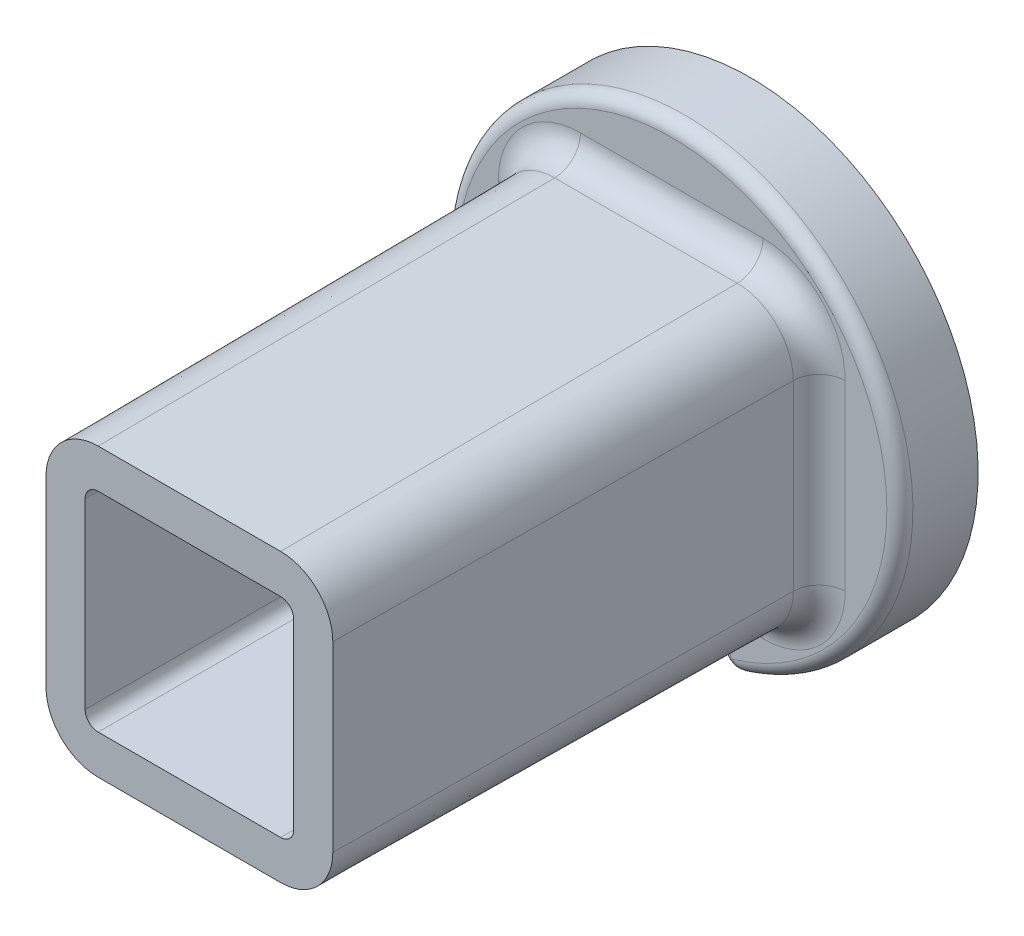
ISO-10303-21;
HEADER;
FILE_DESCRIPTION(('STEP AP214'),'2;1');
FILE_NAME('part.step','',(''),(''),'','','');
FILE_SCHEMA(('AUTOMOTIVE_DESIGN { 1 0 10303 214 1 1 1 1 }'));
ENDSEC;
DATA;
#1=APPLICATION_CONTEXT('core data for automotive mechanical design processes');
#2=APPLICATION_PROTOCOL_DEFINITION('international standard','automotive_design',2000,#1);
#3=PRODUCT_CONTEXT('',#1,'mechanical');
#4=PRODUCT('Part','Part','',(#3));
#5=PRODUCT_RELATED_PRODUCT_CATEGORY('part','',(#4));
#6=PRODUCT_DEFINITION_FORMATION('','',#4);
#7=PRODUCT_DEFINITION_CONTEXT('part definition',#1,'design');
#8=PRODUCT_DEFINITION('design','',#6,#7);
#9=PRODUCT_DEFINITION_SHAPE('','',#8);
#10=(LENGTH_UNIT() NAMED_UNIT(*) SI_UNIT(.MILLI.,.METRE.));
#11=(NAMED_UNIT(*) PLANE_ANGLE_UNIT() SI_UNIT($,.RADIAN.));
#12=(NAMED_UNIT(*) SI_UNIT($,.STERADIAN.) SOLID_ANGLE_UNIT());
#13=UNCERTAINTY_MEASURE_WITH_UNIT(LENGTH_MEASURE(1.E-05),#10,'distance_accuracy_value','');
#14=(GEOMETRIC_REPRESENTATION_CONTEXT(3) GLOBAL_UNCERTAINTY_ASSIGNED_CONTEXT((#13)) GLOBAL_UNIT_ASSIGNED_CONTEXT((#10,
#11,#12)) REPRESENTATION_CONTEXT('',''));
#15=CARTESIAN_POINT('',(0.,0.,0.));
#16=DIRECTION('',(0.,0.,1.));
#17=DIRECTION('',(1.,0.,0.));
#18=AXIS2_PLACEMENT_3D('',#15,#16,#17);
#19=CARTESIAN_POINT('',(5.81484889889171,-16.5056818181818,5.));
#20=CARTESIAN_POINT('',(5.81484889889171,-16.5056818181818,5.));
#21=CARTESIAN_POINT('',(5.81484889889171,-16.5056818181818,5.));
#22=CARTESIAN_POINT('',(5.81484889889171,-16.5056818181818,5.));
#23=CARTESIAN_POINT('',(5.81484889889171,-16.5056818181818,5.));
#24=CARTESIAN_POINT('',(5.70141664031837,-16.5456432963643,5.16028857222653));
#25=CARTESIAN_POINT('',(5.6927741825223,-16.5486879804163,5.14693119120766));
#26=CARTESIAN_POINT('',(5.67548926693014,-16.5547773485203,5.12021642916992));
#27=CARTESIAN_POINT('',(5.65820435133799,-16.5608667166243,5.09350166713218));
#28=CARTESIAN_POINT('',(5.64956189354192,-16.5639114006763,5.08014428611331));
#29=CARTESIAN_POINT('',(5.57448206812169,-16.548625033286,5.32137882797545));
#30=CARTESIAN_POINT('',(5.55938189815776,-16.5609341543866,5.29458848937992));
#31=CARTESIAN_POINT('',(5.5274462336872,-16.5805664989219,5.24094281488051));
#32=CARTESIAN_POINT('',(5.49207697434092,-16.5908729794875,5.18743928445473));
#33=CARTESIAN_POINT('',(5.4735613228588,-16.593667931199,5.16068941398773));
#34=CARTESIAN_POINT('',(5.31531470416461,-16.4748761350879,5.60484383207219));
#35=CARTESIAN_POINT('',(5.28756220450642,-16.514357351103,5.56316314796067));
#36=CARTESIAN_POINT('',(5.22607862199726,-16.574892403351,5.46700579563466));
#37=CARTESIAN_POINT('',(5.16027282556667,-16.5913553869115,5.35728769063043));
#38=CARTESIAN_POINT('',(5.12833861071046,-16.5880438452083,5.3024219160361));
#39=CARTESIAN_POINT('',(5.18490368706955,-16.4060911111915,5.72995256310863));
#40=CARTESIAN_POINT('',(5.15105186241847,-16.4628139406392,5.68596675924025));
#41=CARTESIAN_POINT('',(5.0749485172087,-16.5496698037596,5.57335764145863));
#42=CARTESIAN_POINT('',(4.99623716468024,-16.5677996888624,5.43444490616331));
#43=CARTESIAN_POINT('',(4.96021683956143,-16.5588752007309,5.36497628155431));
#44=CARTESIAN_POINT('',(4.96644227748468,-16.2267086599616,5.88964511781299));
#45=CARTESIAN_POINT('',(4.91666284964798,-16.3087129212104,5.85543394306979));
#46=CARTESIAN_POINT('',(4.8082502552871,-16.4432108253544,5.73147307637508));
#47=CARTESIAN_POINT('',(4.71991950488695,-16.4722131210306,5.54045101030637));
#48=CARTESIAN_POINT('',(4.68858668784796,-16.4577434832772,5.4448225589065));
#49=CARTESIAN_POINT('',(4.88193527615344,-16.1422209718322,5.93969041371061));
#50=CARTESIAN_POINT('',(4.82453388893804,-16.2330062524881,5.9125495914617));
#51=CARTESIAN_POINT('',(4.70160926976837,-16.386681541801,5.78817868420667));
#52=CARTESIAN_POINT('',(4.61255566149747,-16.421923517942,5.57607988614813));
#53=CARTESIAN_POINT('',(4.58586841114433,-16.406327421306,5.46984520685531));
#54=CARTESIAN_POINT('',(4.74607802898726,-15.9768497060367,5.98908225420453));
#55=CARTESIAN_POINT('',(4.6726272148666,-16.0747085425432,5.97682042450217));
#56=CARTESIAN_POINT('',(4.52151531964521,-16.2541888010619,5.85906439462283));
#57=CARTESIAN_POINT('',(4.43883866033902,-16.3100885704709,5.61628861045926));
#58=CARTESIAN_POINT('',(4.42536820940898,-16.2998307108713,5.49454112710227));
#59=CARTESIAN_POINT('',(4.69456409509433,-15.9067853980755,6.));
#60=CARTESIAN_POINT('',(4.61407975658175,-16.0054939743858,5.99418007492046));
#61=CARTESIAN_POINT('',(4.4510708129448,-16.1933784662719,5.88070011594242));
#62=CARTESIAN_POINT('',(4.37270780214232,-16.2598796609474,5.62719461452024));
#63=CARTESIAN_POINT('',(4.36566884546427,-16.2535123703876,5.5));
#64=CARTESIAN_POINT('',(4.64559465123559,-15.8325124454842,6.));
#65=CARTESIAN_POINT('',(4.55778208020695,-15.9295880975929,6.));
#66=CARTESIAN_POINT('',(4.38285605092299,-16.1229665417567,5.89165693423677));
#67=CARTESIAN_POINT('',(4.31017533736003,-16.2033141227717,5.63089969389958));
#68=CARTESIAN_POINT('',(4.31017533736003,-16.2033141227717,5.5));
#69=B_SPLINE_SURFACE_WITH_KNOTS('',3,3,((#19,#20,#21,#22,#23),(#24,#25,#26,#27,#28),(#29,#30,
#31,#32,#33),(#34,#35,#36,#37,#38),(#39,#40,#41,#42,#43),(#44,#45,#46,#47,#48),(#49,#50,#51,#52,
#53),(#54,#55,#56,#57,#58),(#59,#60,#61,#62,#63),(#64,#65,#66,#67,#68)),.UNSPECIFIED.,.F.,.F.,
.F.,(4,2,2,2,4),(4,1,4),(-0.119726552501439,-0.077223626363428,-0.038911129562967,
-0.014965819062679,0.),(0.,0.5,1.),.UNSPECIFIED.);
#70=CARTESIAN_POINT('',(4.31017533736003,-16.2033141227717,5.5));
#71=CARTESIAN_POINT('',(4.36566884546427,-16.2535123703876,5.5));
#72=CARTESIAN_POINT('',(4.42536820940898,-16.2998307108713,5.49454112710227));
#73=CARTESIAN_POINT('',(4.58586841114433,-16.406327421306,5.46984520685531));
#74=CARTESIAN_POINT('',(4.68858668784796,-16.4577434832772,5.4448225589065));
#75=CARTESIAN_POINT('',(4.96021683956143,-16.5588752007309,5.36497628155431));
#76=CARTESIAN_POINT('',(5.12833861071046,-16.5880438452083,5.3024219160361));
#77=CARTESIAN_POINT('',(5.4735613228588,-16.593667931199,5.16068941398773));
#78=CARTESIAN_POINT('',(5.64956189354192,-16.5639114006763,5.08014428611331));
#79=CARTESIAN_POINT('',(5.81484889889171,-16.5056818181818,5.));
#80=B_SPLINE_CURVE_WITH_KNOTS('',3,(#70,#71,#72,#73,#74,#75,#76,#77,#78,#79),.UNSPECIFIED.,.F.,
.F.,(4,2,2,2,4),(-0.119726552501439,-0.10476073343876,-0.0808154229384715,-0.0425029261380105,
0.),.UNSPECIFIED.);
#81=CARTESIAN_POINT('',(5.81484889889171,-16.5056818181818,5.));
#82=VERTEX_POINT('',#81);
#83=CARTESIAN_POINT('',(4.31017533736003,-16.2033141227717,5.5));
#84=VERTEX_POINT('',#83);
#85=EDGE_CURVE('E723',#82,#84,#80,.F.);
#86=CARTESIAN_POINT('',(5.81484889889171,-16.5056818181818,5.));
#87=CARTESIAN_POINT('',(5.70141664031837,-16.5456432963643,5.16028857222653));
#88=CARTESIAN_POINT('',(5.57448206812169,-16.548625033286,5.32137882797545));
#89=CARTESIAN_POINT('',(5.31531470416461,-16.4748761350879,5.60484383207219));
#90=CARTESIAN_POINT('',(5.18490368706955,-16.4060911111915,5.72995256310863));
#91=CARTESIAN_POINT('',(4.96644227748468,-16.2267086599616,5.88964511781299));
#92=CARTESIAN_POINT('',(4.88193527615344,-16.1422209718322,5.93969041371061));
#93=CARTESIAN_POINT('',(4.74607802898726,-15.9768497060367,5.98908225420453));
#94=CARTESIAN_POINT('',(4.69456409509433,-15.9067853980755,6.));
#95=CARTESIAN_POINT('',(4.64559465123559,-15.8325124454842,6.));
#96=B_SPLINE_CURVE_WITH_KNOTS('',3,(#86,#87,#88,#89,#90,#91,#92,#93,#94,#95),.UNSPECIFIED.,.F.,
.F.,(4,2,2,2,4),(-0.119726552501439,-0.077223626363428,-0.038911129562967,-0.014965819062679,
0.),.UNSPECIFIED.);
#97=CARTESIAN_POINT('',(4.64559465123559,-15.8325124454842,6.));
#98=VERTEX_POINT('',#97);
#99=EDGE_CURVE('E1085',#98,#82,#96,.F.);
#100=CARTESIAN_POINT('',(4.64559465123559,-15.8325124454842,6.));
#101=CARTESIAN_POINT('',(4.55778208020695,-15.9295880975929,6.));
#102=CARTESIAN_POINT('',(4.38285605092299,-16.1229665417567,5.89165693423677));
#103=CARTESIAN_POINT('',(4.31017533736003,-16.2033141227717,5.63089969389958));
#104=CARTESIAN_POINT('',(4.31017533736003,-16.2033141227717,5.5));
#105=B_SPLINE_CURVE_WITH_KNOTS('',3,(#100,#101,#102,#103,#104),.UNSPECIFIED.,.F.,.F.,(4,1,4),
(0.,0.5,1.),.UNSPECIFIED.);
#106=EDGE_CURVE('E233',#84,#98,#105,.F.);
#107=ORIENTED_EDGE('',*,*,#85,.F.);
#108=ORIENTED_EDGE('',*,*,#99,.F.);
#109=ORIENTED_EDGE('',*,*,#106,.F.);
#110=EDGE_LOOP('',(#107,#108,#109));
#111=FACE_BOUND('',#110,.T.);
#112=ADVANCED_FACE('F16',(#111),#69,.T.);
#113=CARTESIAN_POINT('',(-4.6455946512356,-15.8325124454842,6.));
#114=CARTESIAN_POINT('',(-4.55778208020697,-15.929588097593,6.));
#115=CARTESIAN_POINT('',(-4.38285605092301,-16.1229665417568,5.89165693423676));
#116=CARTESIAN_POINT('',(-4.31017533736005,-16.2033141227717,5.63089969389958));
#117=CARTESIAN_POINT('',(-4.31017533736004,-16.2033141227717,5.5));
#118=CARTESIAN_POINT('',(-4.69456409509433,-15.9067853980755,6.));
#119=CARTESIAN_POINT('',(-4.61407975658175,-16.0054939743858,5.99418007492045));
#120=CARTESIAN_POINT('',(-4.4510708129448,-16.1933784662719,5.88070011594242));
#121=CARTESIAN_POINT('',(-4.37270780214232,-16.2598796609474,5.62719461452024));
#122=CARTESIAN_POINT('',(-4.36566884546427,-16.2535123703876,5.5));
#123=CARTESIAN_POINT('',(-4.74607802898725,-15.9768497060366,5.98908225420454));
#124=CARTESIAN_POINT('',(-4.67262721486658,-16.0747085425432,5.97682042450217));
#125=CARTESIAN_POINT('',(-4.52151531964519,-16.2541888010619,5.85906439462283));
#126=CARTESIAN_POINT('',(-4.43883866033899,-16.3100885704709,5.61628861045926));
#127=CARTESIAN_POINT('',(-4.42536820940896,-16.2998307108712,5.49454112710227));
#128=CARTESIAN_POINT('',(-4.88193527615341,-16.1422209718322,5.93969041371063));
#129=CARTESIAN_POINT('',(-4.824533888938,-16.2330062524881,5.91254959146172));
#130=CARTESIAN_POINT('',(-4.70160926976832,-16.386681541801,5.78817868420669));
#131=CARTESIAN_POINT('',(-4.61255566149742,-16.421923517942,5.57607988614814));
#132=CARTESIAN_POINT('',(-4.58586841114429,-16.406327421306,5.46984520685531));
#133=CARTESIAN_POINT('',(-4.96644227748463,-16.2267086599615,5.88964511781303));
#134=CARTESIAN_POINT('',(-4.91666284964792,-16.3087129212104,5.85543394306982));
#135=CARTESIAN_POINT('',(-4.80825025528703,-16.4432108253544,5.73147307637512));
#136=CARTESIAN_POINT('',(-4.71991950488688,-16.4722131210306,5.54045101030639));
#137=CARTESIAN_POINT('',(-4.68858668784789,-16.4577434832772,5.44482255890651));
#138=CARTESIAN_POINT('',(-5.18490368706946,-16.4060911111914,5.72995256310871));
#139=CARTESIAN_POINT('',(-5.15105186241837,-16.4628139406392,5.68596675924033));
#140=CARTESIAN_POINT('',(-5.07494851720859,-16.5496698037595,5.5733576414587));
#141=CARTESIAN_POINT('',(-4.99623716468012,-16.5677996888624,5.43444490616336));
#142=CARTESIAN_POINT('',(-4.96021683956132,-16.5588752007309,5.36497628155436));
#143=CARTESIAN_POINT('',(-5.31531470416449,-16.4748761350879,5.6048438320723));
#144=CARTESIAN_POINT('',(-5.28756220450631,-16.514357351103,5.56316314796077));
#145=CARTESIAN_POINT('',(-5.22607862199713,-16.574892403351,5.46700579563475));
#146=CARTESIAN_POINT('',(-5.16027282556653,-16.5913553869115,5.35728769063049));
#147=CARTESIAN_POINT('',(-5.12833861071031,-16.5880438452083,5.30242191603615));
#148=CARTESIAN_POINT('',(-5.57448206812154,-16.548625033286,5.32137882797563));
#149=CARTESIAN_POINT('',(-5.55938189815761,-16.5609341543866,5.29458848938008));
#150=CARTESIAN_POINT('',(-5.52744623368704,-16.5805664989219,5.24094281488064));
#151=CARTESIAN_POINT('',(-5.49207697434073,-16.5908729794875,5.18743928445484));
#152=CARTESIAN_POINT('',(-5.4735613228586,-16.5936679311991,5.16068941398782));
#153=CARTESIAN_POINT('',(-5.70141664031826,-16.5456432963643,5.16028857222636));
#154=CARTESIAN_POINT('',(-5.6927741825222,-16.5486879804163,5.14693119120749));
#155=CARTESIAN_POINT('',(-5.67548926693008,-16.5547773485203,5.12021642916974));
#156=CARTESIAN_POINT('',(-5.65820435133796,-16.5608667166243,5.09350166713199));
#157=CARTESIAN_POINT('',(-5.6495618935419,-16.5639114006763,5.08014428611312));
#158=CARTESIAN_POINT('',(-5.81484889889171,-16.5056818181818,5.));
#159=CARTESIAN_POINT('',(-5.81484889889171,-16.5056818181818,5.));
#160=CARTESIAN_POINT('',(-5.81484889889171,-16.5056818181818,5.));
#161=CARTESIAN_POINT('',(-5.81484889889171,-16.5056818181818,5.));
#162=CARTESIAN_POINT('',(-5.81484889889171,-16.5056818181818,5.));
#163=B_SPLINE_SURFACE_WITH_KNOTS('',3,3,((#113,#114,#115,#116,#117),(#118,#119,#120,#121,#122),
(#123,#124,#125,#126,#127),(#128,#129,#130,#131,#132),(#133,#134,#135,#136,#137),(#138,#139,
#140,#141,#142),(#143,#144,#145,#146,#147),(#148,#149,#150,#151,#152),(#153,#154,#155,#156,
#157),(#158,#159,#160,#161,#162)),.UNSPECIFIED.,.F.,.F.,.F.,(4,2,2,2,4),(4,1,4),
(-0.119168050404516,-0.104202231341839,-0.080256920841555,-0.041944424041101,0.000558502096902),
(0.,0.5,1.),.UNSPECIFIED.);
#164=CARTESIAN_POINT('',(-5.81484889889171,-16.5056818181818,5.));
#165=CARTESIAN_POINT('',(-5.6495618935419,-16.5639114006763,5.08014428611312));
#166=CARTESIAN_POINT('',(-5.4735613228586,-16.5936679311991,5.16068941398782));
#167=CARTESIAN_POINT('',(-5.12833861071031,-16.5880438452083,5.30242191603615));
#168=CARTESIAN_POINT('',(-4.96021683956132,-16.5588752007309,5.36497628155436));
#169=CARTESIAN_POINT('',(-4.68858668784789,-16.4577434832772,5.44482255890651));
#170=CARTESIAN_POINT('',(-4.58586841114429,-16.406327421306,5.46984520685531));
#171=CARTESIAN_POINT('',(-4.42536820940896,-16.2998307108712,5.49454112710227));
#172=CARTESIAN_POINT('',(-4.36566884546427,-16.2535123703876,5.5));
#173=CARTESIAN_POINT('',(-4.31017533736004,-16.2033141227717,5.5));
#174=B_SPLINE_CURVE_WITH_KNOTS('',3,(#164,#165,#166,#167,#168,#169,#170,#171,#172,#173),
.UNSPECIFIED.,.F.,.F.,(4,2,2,2,4),(-0.119168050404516,-0.076665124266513,-0.038352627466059,
-0.014407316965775,0.000558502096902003),.UNSPECIFIED.);
#175=CARTESIAN_POINT('',(-4.31017533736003,-16.2033141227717,5.5));
#176=VERTEX_POINT('',#175);
#177=CARTESIAN_POINT('',(-5.81484889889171,-16.5056818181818,5.));
#178=VERTEX_POINT('',#177);
#179=EDGE_CURVE('E711',#176,#178,#174,.F.);
#180=CARTESIAN_POINT('',(-4.31017533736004,-16.2033141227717,5.5));
#181=CARTESIAN_POINT('',(-4.31017533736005,-16.2033141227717,5.63089969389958));
#182=CARTESIAN_POINT('',(-4.38285605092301,-16.1229665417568,5.89165693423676));
#183=CARTESIAN_POINT('',(-4.55778208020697,-15.929588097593,6.));
#184=CARTESIAN_POINT('',(-4.6455946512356,-15.8325124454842,6.));
#185=B_SPLINE_CURVE_WITH_KNOTS('',3,(#180,#181,#182,#183,#184),.UNSPECIFIED.,.F.,.F.,(4,1,4),
(0.,0.5,1.),.UNSPECIFIED.);
#186=CARTESIAN_POINT('',(-4.64559465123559,-15.8325124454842,6.));
#187=VERTEX_POINT('',#186);
#188=EDGE_CURVE('E234',#187,#176,#185,.F.);
#189=CARTESIAN_POINT('',(-4.6455946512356,-15.8325124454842,6.));
#190=CARTESIAN_POINT('',(-4.69456409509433,-15.9067853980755,6.));
#191=CARTESIAN_POINT('',(-4.74607802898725,-15.9768497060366,5.98908225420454));
#192=CARTESIAN_POINT('',(-4.88193527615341,-16.1422209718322,5.93969041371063));
#193=CARTESIAN_POINT('',(-4.96644227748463,-16.2267086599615,5.88964511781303));
#194=CARTESIAN_POINT('',(-5.18490368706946,-16.4060911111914,5.72995256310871));
#195=CARTESIAN_POINT('',(-5.31531470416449,-16.4748761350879,5.6048438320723));
#196=CARTESIAN_POINT('',(-5.57448206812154,-16.548625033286,5.32137882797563));
#197=CARTESIAN_POINT('',(-5.70141664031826,-16.5456432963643,5.16028857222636));
#198=CARTESIAN_POINT('',(-5.81484889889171,-16.5056818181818,5.));
#199=B_SPLINE_CURVE_WITH_KNOTS('',3,(#189,#190,#191,#192,#193,#194,#195,#196,#197,#198),
.UNSPECIFIED.,.F.,.F.,(4,2,2,2,4),(-0.119168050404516,-0.104202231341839,-0.080256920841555,
-0.041944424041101,0.000558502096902),.UNSPECIFIED.);
#200=EDGE_CURVE('E827',#178,#187,#199,.F.);
#201=ORIENTED_EDGE('',*,*,#179,.F.);
#202=ORIENTED_EDGE('',*,*,#188,.F.);
#203=ORIENTED_EDGE('',*,*,#200,.F.);
#204=EDGE_LOOP('',(#201,#202,#203));
#205=FACE_BOUND('',#204,.T.);
#206=ADVANCED_FACE('F662',(#205),#163,.T.);
#207=CARTESIAN_POINT('',(-5.3164332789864,-15.0909090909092,5.50000000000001));
#208=DIRECTION('',(0.,0.,-1.));
#209=DIRECTION('',(-1.,0.,0.));
#210=AXIS2_PLACEMENT_3D('',#207,#208,#209);
#211=TOROIDAL_SURFACE('',#210,0.999999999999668,0.499999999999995);
#212=CARTESIAN_POINT('',(-4.34980904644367,-15.3471074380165,5.5));
#213=DIRECTION('',(0.256198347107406,0.966624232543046,0.));
#214=DIRECTION('',(-0.966624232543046,0.256198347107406,0.));
#215=AXIS2_PLACEMENT_3D('',#212,#213,#214);
#216=CIRCLE('',#215,0.499999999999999);
#217=CARTESIAN_POINT('',(-4.34980904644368,-15.3471074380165,6.));
#218=VERTEX_POINT('',#217);
#219=CARTESIAN_POINT('',(-3.86649693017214,-15.4752066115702,5.5));
#220=VERTEX_POINT('',#219);
#221=EDGE_CURVE('E223',#218,#220,#216,.T.);
#222=ORIENTED_EDGE('',*,*,#221,.F.);
#223=CARTESIAN_POINT('',(-5.3164332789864,-15.0909090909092,6.));
#224=DIRECTION('',(0.,0.,-1.));
#225=DIRECTION('',(-1.,0.,0.));
#226=AXIS2_PLACEMENT_3D('',#223,#224,#225);
#227=CIRCLE('',#226,0.999999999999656);
#228=EDGE_CURVE('E227',#187,#218,#227,.F.);
#229=ORIENTED_EDGE('',*,*,#228,.F.);
#230=ORIENTED_EDGE('',*,*,#188,.T.);
#231=CARTESIAN_POINT('',(-5.31643327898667,-15.090909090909,5.5));
#232=DIRECTION('',(0.,0.,-1.));
#233=DIRECTION('',(-1.,0.,0.));
#234=AXIS2_PLACEMENT_3D('',#231,#232,#233);
#235=CIRCLE('',#234,1.50000000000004);
#236=EDGE_CURVE('E230',#220,#176,#235,.T.);
#237=ORIENTED_EDGE('',*,*,#236,.F.);
#238=EDGE_LOOP('',(#222,#229,#230,#237));
#239=FACE_BOUND('',#238,.T.);
#240=ADVANCED_FACE('F225',(#239),#211,.T.);
#241=CARTESIAN_POINT('',(0.,-16.5,5.5));
#242=DIRECTION('',(0.,0.,-1.));
#243=DIRECTION('',(-1.,0.,0.));
#244=AXIS2_PLACEMENT_3D('',#241,#242,#243);
#245=TOROIDAL_SURFACE('',#244,4.50000000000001,0.499999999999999);
#246=CARTESIAN_POINT('',(-3.16942823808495,-13.305516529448,6.));
#247=CARTESIAN_POINT('',(-3.07723330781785,-13.3984402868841,6.));
#248=CARTESIAN_POINT('',(-2.89357744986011,-13.5835479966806,5.89165693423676));
#249=CARTESIAN_POINT('',(-2.8172695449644,-13.6604591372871,5.63089969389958));
#250=CARTESIAN_POINT('',(-2.8172695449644,-13.6604591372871,5.5));
#251=B_SPLINE_CURVE_WITH_KNOTS('',3,(#246,#247,#248,#249,#250),.UNSPECIFIED.,.F.,.F.,(4,1,4),
(0.,0.5,1.),.UNSPECIFIED.);
#252=CARTESIAN_POINT('',(-3.16942823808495,-13.305516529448,6.));
#253=VERTEX_POINT('',#252);
#254=CARTESIAN_POINT('',(-2.8172695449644,-13.6604591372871,5.5));
#255=VERTEX_POINT('',#254);
#256=EDGE_CURVE('E240',#253,#255,#251,.T.);
#257=ORIENTED_EDGE('',*,*,#256,.F.);
#258=CARTESIAN_POINT('',(0.,-16.5,6.));
#259=DIRECTION('',(0.,0.,-1.));
#260=DIRECTION('',(-1.,0.,0.));
#261=AXIS2_PLACEMENT_3D('',#258,#259,#260);
#262=CIRCLE('',#261,4.5);
#263=EDGE_CURVE('E237',#218,#253,#262,.T.);
#264=ORIENTED_EDGE('',*,*,#263,.F.);
#265=ORIENTED_EDGE('',*,*,#221,.T.);
#266=CARTESIAN_POINT('',(0.,-16.5,5.5));
#267=DIRECTION('',(0.,0.,1.));
#268=DIRECTION('',(0.,-1.,0.));
#269=AXIS2_PLACEMENT_3D('',#266,#267,#268);
#270=CIRCLE('',#269,3.99999999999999);
#271=EDGE_CURVE('E1093',#255,#220,#270,.T.);
#272=ORIENTED_EDGE('',*,*,#271,.F.);
#273=EDGE_LOOP('',(#257,#264,#265,#272));
#274=FACE_BOUND('',#273,.T.);
#275=ADVANCED_FACE('F238',(#274),#245,.T.);
#276=CARTESIAN_POINT('',(0.,-16.5,5.5));
#277=DIRECTION('',(0.,0.,-1.));
#278=DIRECTION('',(-1.,0.,0.));
#279=AXIS2_PLACEMENT_3D('',#276,#277,#278);
#280=TOROIDAL_SURFACE('',#279,4.50000000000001,0.499999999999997);
#281=CARTESIAN_POINT('',(2.8172695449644,-13.6604591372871,5.5));
#282=CARTESIAN_POINT('',(2.8172695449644,-13.6604591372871,5.63089969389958));
#283=CARTESIAN_POINT('',(2.89357744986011,-13.5835479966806,5.89165693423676));
#284=CARTESIAN_POINT('',(3.07723330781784,-13.3984402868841,6.));
#285=CARTESIAN_POINT('',(3.16942823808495,-13.305516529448,6.));
#286=B_SPLINE_CURVE_WITH_KNOTS('',3,(#281,#282,#283,#284,#285),.UNSPECIFIED.,.F.,.F.,(4,1,4),
(0.,0.5,1.),.UNSPECIFIED.);
#287=CARTESIAN_POINT('',(2.81726954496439,-13.6604591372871,5.5));
#288=VERTEX_POINT('',#287);
#289=CARTESIAN_POINT('',(3.16942823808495,-13.305516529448,6.));
#290=VERTEX_POINT('',#289);
#291=EDGE_CURVE('E690',#288,#290,#286,.T.);
#292=ORIENTED_EDGE('',*,*,#291,.F.);
#293=CARTESIAN_POINT('',(0.,-16.5,5.5));
#294=DIRECTION('',(0.,0.,1.));
#295=DIRECTION('',(0.,-1.,0.));
#296=AXIS2_PLACEMENT_3D('',#293,#294,#295);
#297=CIRCLE('',#296,3.99999999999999);
#298=CARTESIAN_POINT('',(3.86649693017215,-15.4752066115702,5.5));
#299=VERTEX_POINT('',#298);
#300=EDGE_CURVE('E1074',#299,#288,#297,.T.);
#301=ORIENTED_EDGE('',*,*,#300,.F.);
#302=CARTESIAN_POINT('',(4.34980904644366,-15.3471074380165,5.5));
#303=DIRECTION('',(0.256198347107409,-0.966624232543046,0.));
#304=DIRECTION('',(0.966624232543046,0.256198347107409,0.));
#305=AXIS2_PLACEMENT_3D('',#302,#303,#304);
#306=CIRCLE('',#305,0.499999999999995);
#307=CARTESIAN_POINT('',(4.34980904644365,-15.3471074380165,5.99999999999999));
#308=VERTEX_POINT('',#307);
#309=EDGE_CURVE('E217',#308,#299,#306,.T.);
#310=ORIENTED_EDGE('',*,*,#309,.F.);
#311=CARTESIAN_POINT('',(0.,-16.5,6.));
#312=DIRECTION('',(0.,0.,-1.));
#313=DIRECTION('',(-1.,0.,0.));
#314=AXIS2_PLACEMENT_3D('',#311,#312,#313);
#315=CIRCLE('',#314,4.50000000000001);
#316=EDGE_CURVE('E245',#290,#308,#315,.T.);
#317=ORIENTED_EDGE('',*,*,#316,.F.);
#318=EDGE_LOOP('',(#292,#301,#310,#317));
#319=FACE_BOUND('',#318,.T.);
#320=ADVANCED_FACE('F799',(#319),#280,.T.);
#321=CARTESIAN_POINT('',(5.31643327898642,-15.0909090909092,5.5));
#322=DIRECTION('',(0.,0.,-1.));
#323=DIRECTION('',(-1.,0.,0.));
#324=AXIS2_PLACEMENT_3D('',#321,#322,#323);
#325=TOROIDAL_SURFACE('',#324,0.999999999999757,0.499999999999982);
#326=ORIENTED_EDGE('',*,*,#309,.T.);
#327=CARTESIAN_POINT('',(5.31643327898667,-15.090909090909,5.5));
#328=DIRECTION('',(0.,0.,-1.));
#329=DIRECTION('',(-1.,0.,0.));
#330=AXIS2_PLACEMENT_3D('',#327,#328,#329);
#331=CIRCLE('',#330,1.50000000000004);
#332=EDGE_CURVE('E1088',#84,#299,#331,.T.);
#333=ORIENTED_EDGE('',*,*,#332,.F.);
#334=ORIENTED_EDGE('',*,*,#106,.T.);
#335=CARTESIAN_POINT('',(5.31643327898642,-15.0909090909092,5.99999999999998));
#336=DIRECTION('',(0.,0.,-1.));
#337=DIRECTION('',(-1.,0.,0.));
#338=AXIS2_PLACEMENT_3D('',#335,#336,#337);
#339=CIRCLE('',#338,0.999999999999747);
#340=EDGE_CURVE('E261',#308,#98,#339,.F.);
#341=ORIENTED_EDGE('',*,*,#340,.F.);
#342=EDGE_LOOP('',(#326,#333,#334,#341));
#343=FACE_BOUND('',#342,.T.);
#344=ADVANCED_FACE('F803',(#343),#325,.T.);
#345=CARTESIAN_POINT('',(0.,0.,5.));
#346=DIRECTION('',(0.,0.,-1.));
#347=DIRECTION('',(-1.,0.,0.));
#348=AXIS2_PLACEMENT_3D('',#345,#346,#347);
#349=TOROIDAL_SURFACE('',#348,16.5000000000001,0.999999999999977);
#350=CARTESIAN_POINT('',(0.,0.,5.));
#351=DIRECTION('',(0.,0.,-1.));
#352=DIRECTION('',(-1.,0.,0.));
#353=AXIS2_PLACEMENT_3D('',#350,#351,#352);
#354=CIRCLE('',#353,17.4999999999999);
#355=EDGE_CURVE('E695',#178,#82,#354,.T.);
#356=ORIENTED_EDGE('',*,*,#355,.F.);
#357=ORIENTED_EDGE('',*,*,#200,.T.);
#358=CARTESIAN_POINT('',(0.,0.,5.99999999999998));
#359=DIRECTION('',(0.,0.,-1.));
#360=DIRECTION('',(-1.,0.,0.));
#361=AXIS2_PLACEMENT_3D('',#358,#359,#360);
#362=CIRCLE('',#361,16.5);
#363=EDGE_CURVE('E251',#98,#187,#362,.F.);
#364=ORIENTED_EDGE('',*,*,#363,.F.);
#365=ORIENTED_EDGE('',*,*,#99,.T.);
#366=EDGE_LOOP('',(#356,#357,#364,#365));
#367=FACE_BOUND('',#366,.T.);
#368=ADVANCED_FACE('F832',(#367),#349,.T.);
#369=CARTESIAN_POINT('',(5.31643327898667,-15.090909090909,0.));
#370=DIRECTION('',(0.,0.,1.));
#371=DIRECTION('',(1.,0.,0.));
#372=AXIS2_PLACEMENT_3D('',#369,#370,#371);
#373=CYLINDRICAL_SURFACE('',#372,1.50000000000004);
#374=DIRECTION('',(0.,0.,-1.));
#375=VECTOR('',#374,1.);
#376=CARTESIAN_POINT('',(5.8148488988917,-16.5056818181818,2.5));
#377=LINE('',#376,#375);
#378=CARTESIAN_POINT('',(5.81484889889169,-16.5056818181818,0.));
#379=VERTEX_POINT('',#378);
#380=EDGE_CURVE('E703',#82,#379,#377,.T.);
#381=ORIENTED_EDGE('',*,*,#380,.F.);
#382=ORIENTED_EDGE('',*,*,#85,.T.);
#383=ORIENTED_EDGE('',*,*,#332,.T.);
#384=DIRECTION('',(0.,0.,1.));
#385=VECTOR('',#384,1.);
#386=CARTESIAN_POINT('',(3.86649693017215,-15.4752066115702,2.93399821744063));
#387=LINE('',#386,#385);
#388=CARTESIAN_POINT('',(3.86649693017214,-15.4752066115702,0.));
#389=VERTEX_POINT('',#388);
#390=EDGE_CURVE('E1077',#389,#299,#387,.T.);
#391=ORIENTED_EDGE('',*,*,#390,.F.);
#392=CARTESIAN_POINT('',(5.31643327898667,-15.090909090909,0.));
#393=DIRECTION('',(0.,0.,1.));
#394=DIRECTION('',(1.,0.,0.));
#395=AXIS2_PLACEMENT_3D('',#392,#393,#394);
#396=CIRCLE('',#395,1.50000000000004);
#397=EDGE_CURVE('E268',#379,#389,#396,.F.);
#398=ORIENTED_EDGE('',*,*,#397,.F.);
#399=EDGE_LOOP('',(#381,#382,#383,#391,#398));
#400=FACE_BOUND('',#399,.T.);
#401=ADVANCED_FACE('F841',(#400),#373,.T.);
#402=CARTESIAN_POINT('',(0.,-16.5,5.86799643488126));
#403=DIRECTION('',(0.,0.,-1.));
#404=DIRECTION('',(0.,1.,0.));
#405=AXIS2_PLACEMENT_3D('',#402,#403,#404);
#406=CYLINDRICAL_SURFACE('',#405,3.99999999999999);
#407=ORIENTED_EDGE('',*,*,#300,.T.);
#408=CARTESIAN_POINT('',(-2.8172695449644,-13.6604591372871,5.5));
#409=CARTESIAN_POINT('',(-2.55798202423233,-13.4032052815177,5.5));
#410=CARTESIAN_POINT('',(-2.26059493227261,-13.1802965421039,5.55029850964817));
#411=CARTESIAN_POINT('',(-1.5835594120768,-12.803640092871,5.68120651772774));
#412=CARTESIAN_POINT('',(-1.18750264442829,-12.6576173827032,5.76659105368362));
#413=CARTESIAN_POINT('',(-0.52248785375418,-12.5257074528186,5.8495166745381));
#414=CARTESIAN_POINT('',(-0.26221854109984,-12.4999362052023,5.86799643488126));
#415=CARTESIAN_POINT('',(0.132566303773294,-12.500032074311,5.867930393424));
#416=CARTESIAN_POINT('',(0.26441900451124,-12.5065853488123,5.86336585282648));
#417=CARTESIAN_POINT('',(0.604505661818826,-12.5403529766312,5.84063871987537));
#418=CARTESIAN_POINT('',(0.810142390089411,-12.5774197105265,5.8159950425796));
#419=CARTESIAN_POINT('',(1.33159385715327,-12.7135963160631,5.7357940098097));
#420=CARTESIAN_POINT('',(1.64226487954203,-12.8377446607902,5.67004038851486));
#421=CARTESIAN_POINT('',(2.2525141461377,-13.1742654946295,5.55166461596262));
#422=CARTESIAN_POINT('',(2.5542779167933,-13.3995302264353,5.5));
#423=CARTESIAN_POINT('',(2.8172695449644,-13.6604591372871,5.5));
#424=B_SPLINE_CURVE_WITH_KNOTS('',3,(#408,#409,#410,#411,#412,#413,#414,#415,#416,#417,#418,
#419,#420,#421,#422,#423),.UNSPECIFIED.,.F.,.F.,(4,2,2,2,2,2,2,4),(0.,0.123272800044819,
0.26415600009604,0.352208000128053,0.396234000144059,0.46667560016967,0.579382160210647,
0.704416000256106),.UNSPECIFIED.);
#425=EDGE_CURVE('E252',#255,#288,#424,.T.);
#426=ORIENTED_EDGE('',*,*,#425,.F.);
#427=ORIENTED_EDGE('',*,*,#271,.T.);
#428=DIRECTION('',(0.,0.,1.));
#429=VECTOR('',#428,1.);
#430=CARTESIAN_POINT('',(-3.86649693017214,-15.4752066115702,2.75));
#431=LINE('',#430,#429);
#432=CARTESIAN_POINT('',(-3.86649693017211,-15.4752066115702,0.));
#433=VERTEX_POINT('',#432);
#434=EDGE_CURVE('E1101',#433,#220,#431,.T.);
#435=ORIENTED_EDGE('',*,*,#434,.F.);
#436=CARTESIAN_POINT('',(0.,-16.5,0.));
#437=DIRECTION('',(0.,0.,-1.));
#438=DIRECTION('',(0.,1.,0.));
#439=AXIS2_PLACEMENT_3D('',#436,#437,#438);
#440=CIRCLE('',#439,3.99999999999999);
#441=EDGE_CURVE('E271',#389,#433,#440,.F.);
#442=ORIENTED_EDGE('',*,*,#441,.F.);
#443=ORIENTED_EDGE('',*,*,#390,.T.);
#444=EDGE_LOOP('',(#407,#426,#427,#435,#442,#443));
#445=FACE_BOUND('',#444,.T.);
#446=ADVANCED_FACE('F872',(#445),#406,.F.);
#447=CARTESIAN_POINT('',(-5.31643327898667,-15.090909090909,5.5));
#448=DIRECTION('',(0.,0.,-1.));
#449=DIRECTION('',(-1.,0.,0.));
#450=AXIS2_PLACEMENT_3D('',#447,#448,#449);
#451=CYLINDRICAL_SURFACE('',#450,1.50000000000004);
#452=CARTESIAN_POINT('',(-5.31643327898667,-15.090909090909,0.));
#453=DIRECTION('',(0.,0.,-1.));
#454=DIRECTION('',(-1.,0.,0.));
#455=AXIS2_PLACEMENT_3D('',#452,#453,#454);
#456=CIRCLE('',#455,1.50000000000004);
#457=CARTESIAN_POINT('',(-5.8148488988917,-16.5056818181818,0.));
#458=VERTEX_POINT('',#457);
#459=EDGE_CURVE('E274',#433,#458,#456,.T.);
#460=ORIENTED_EDGE('',*,*,#459,.F.);
#461=ORIENTED_EDGE('',*,*,#434,.T.);
#462=ORIENTED_EDGE('',*,*,#236,.T.);
#463=ORIENTED_EDGE('',*,*,#179,.T.);
#464=DIRECTION('',(0.,0.,1.));
#465=VECTOR('',#464,1.);
#466=CARTESIAN_POINT('',(-5.81484889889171,-16.5056818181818,2.5));
#467=LINE('',#466,#465);
#468=EDGE_CURVE('E704',#458,#178,#467,.T.);
#469=ORIENTED_EDGE('',*,*,#468,.F.);
#470=EDGE_LOOP('',(#460,#461,#462,#463,#469));
#471=FACE_BOUND('',#470,.T.);
#472=ADVANCED_FACE('F881',(#471),#451,.T.);
#473=CARTESIAN_POINT('',(0.,0.,5.));
#474=DIRECTION('',(0.,0.,-1.));
#475=DIRECTION('',(-1.,0.,0.));
#476=AXIS2_PLACEMENT_3D('',#473,#474,#475);
#477=CYLINDRICAL_SURFACE('',#476,17.4999999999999);
#478=ORIENTED_EDGE('',*,*,#355,.T.);
#479=ORIENTED_EDGE('',*,*,#380,.T.);
#480=CARTESIAN_POINT('',(0.,0.,0.));
#481=DIRECTION('',(0.,0.,-1.));
#482=DIRECTION('',(-1.,0.,0.));
#483=AXIS2_PLACEMENT_3D('',#480,#481,#482);
#484=CIRCLE('',#483,17.4999999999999);
#485=EDGE_CURVE('E277',#458,#379,#484,.T.);
#486=ORIENTED_EDGE('',*,*,#485,.F.);
#487=ORIENTED_EDGE('',*,*,#468,.T.);
#488=EDGE_LOOP('',(#478,#479,#486,#487));
#489=FACE_BOUND('',#488,.T.);
#490=ADVANCED_FACE('F661',(#489),#477,.T.);
#491=CARTESIAN_POINT('',(-2.8172695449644,-13.6604591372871,5.5));
#492=CARTESIAN_POINT('',(-2.8172695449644,-13.6604591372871,5.63089969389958));
#493=CARTESIAN_POINT('',(-2.89357744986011,-13.5835479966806,5.89165693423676));
#494=CARTESIAN_POINT('',(-3.07723330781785,-13.3984402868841,6.));
#495=CARTESIAN_POINT('',(-3.16942823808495,-13.305516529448,6.));
#496=CARTESIAN_POINT('',(-2.55798202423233,-13.4032052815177,5.5));
#497=CARTESIAN_POINT('',(-2.56555854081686,-13.4107223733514,5.62405141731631));
#498=CARTESIAN_POINT('',(-2.64153077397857,-13.350289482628,5.87140491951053));
#499=CARTESIAN_POINT('',(-2.7988433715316,-13.170468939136,5.98924275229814));
#500=CARTESIAN_POINT('',(-2.87772977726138,-13.0739880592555,6.));
#501=CARTESIAN_POINT('',(-2.26059493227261,-13.1802965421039,5.55029850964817));
#502=CARTESIAN_POINT('',(-2.27315340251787,-13.188960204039,5.66556080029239));
#503=CARTESIAN_POINT('',(-2.34495898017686,-13.1360028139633,5.89555845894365));
#504=CARTESIAN_POINT('',(-2.47700073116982,-12.9673794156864,6.01936962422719));
#505=CARTESIAN_POINT('',(-2.54316929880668,-12.8733701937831,6.04023880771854));
#506=CARTESIAN_POINT('',(-1.5835594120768,-12.803640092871,5.68120651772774));
#507=CARTESIAN_POINT('',(-1.59956697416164,-12.810629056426,5.78079551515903));
#508=CARTESIAN_POINT('',(-1.65535188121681,-12.7660361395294,5.97973683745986));
#509=CARTESIAN_POINT('',(-1.73942376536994,-12.6200748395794,6.10914952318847));
#510=CARTESIAN_POINT('',(-1.7815043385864,-12.5343793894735,6.14496521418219));
#511=CARTESIAN_POINT('',(-1.18750264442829,-12.6576173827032,5.76659105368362));
#512=CARTESIAN_POINT('',(-1.20123872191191,-12.6613686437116,5.85926094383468));
#513=CARTESIAN_POINT('',(-1.24419715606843,-12.6169621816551,6.04442930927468));
#514=CARTESIAN_POINT('',(-1.30534150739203,-12.4825141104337,6.17299245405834));
#515=CARTESIAN_POINT('',(-1.33594047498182,-12.4029589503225,6.2132728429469));
#516=CARTESIAN_POINT('',(-0.52248785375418,-12.5257074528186,5.8495166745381));
#517=CARTESIAN_POINT('',(-0.529291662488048,-12.5264153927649,5.93589632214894));
#518=CARTESIAN_POINT('',(-0.548703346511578,-12.4820932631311,6.1085396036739));
#519=CARTESIAN_POINT('',(-0.574761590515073,-12.358076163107,6.23574393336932));
#520=CARTESIAN_POINT('',(-0.587798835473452,-12.2842400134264,6.27961333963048));
#521=CARTESIAN_POINT('',(-0.26221854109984,-12.4999362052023,5.86799643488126));
#522=CARTESIAN_POINT('',(-0.265635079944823,-12.4999345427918,5.95310665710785));
#523=CARTESIAN_POINT('',(-0.275376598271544,-12.4555019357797,6.12321967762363));
#524=CARTESIAN_POINT('',(-0.288453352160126,-12.3336291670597,6.24994887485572));
#525=CARTESIAN_POINT('',(-0.29499585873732,-12.2610458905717,6.29439714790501));
#526=CARTESIAN_POINT('',(0.132566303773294,-12.500032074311,5.867930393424));
#527=CARTESIAN_POINT('',(0.134293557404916,-12.5000329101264,5.95304528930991));
#528=CARTESIAN_POINT('',(0.13921844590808,-12.4556005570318,6.12316762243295));
#529=CARTESIAN_POINT('',(0.145829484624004,-12.3337199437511,6.24989833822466));
#530=CARTESIAN_POINT('',(0.149137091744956,-12.2611321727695,6.2943443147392));
#531=CARTESIAN_POINT('',(0.26441900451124,-12.5065853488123,5.86336585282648));
#532=CARTESIAN_POINT('',(0.267863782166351,-12.5067593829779,5.94880110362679));
#533=CARTESIAN_POINT('',(0.277686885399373,-12.4623470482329,6.11956182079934));
#534=CARTESIAN_POINT('',(0.290873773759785,-12.3399279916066,6.24640095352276));
#535=CARTESIAN_POINT('',(0.297471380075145,-12.2670301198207,6.29069268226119));
#536=CARTESIAN_POINT('',(0.604505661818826,-12.5403529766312,5.84063871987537));
#537=CARTESIAN_POINT('',(0.612156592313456,-12.5413814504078,5.92771081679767));
#538=CARTESIAN_POINT('',(0.634465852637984,-12.4970306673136,6.10173250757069));
#539=CARTESIAN_POINT('',(0.664860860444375,-12.371871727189,6.22905740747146));
#540=CARTESIAN_POINT('',(0.680068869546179,-12.2974209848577,6.27251097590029));
#541=CARTESIAN_POINT('',(0.810142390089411,-12.5774197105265,5.8159950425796));
#542=CARTESIAN_POINT('',(0.820111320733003,-12.5793760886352,5.90485924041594));
#543=CARTESIAN_POINT('',(0.849824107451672,-12.5350828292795,6.08245098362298));
#544=CARTESIAN_POINT('',(0.890871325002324,-12.4069239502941,6.21028114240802));
#545=CARTESIAN_POINT('',(0.911410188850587,-12.3307810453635,6.25279603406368));
#546=CARTESIAN_POINT('',(1.33159385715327,-12.7135963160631,5.7357940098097));
#547=CARTESIAN_POINT('',(1.34603272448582,-12.7184022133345,5.83105311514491));
#548=CARTESIAN_POINT('',(1.39354092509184,-12.6736956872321,6.02137178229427));
#549=CARTESIAN_POINT('',(1.46318555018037,-12.5350447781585,6.15010725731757));
#550=CARTESIAN_POINT('',(1.49804308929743,-12.4533399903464,6.18863520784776));
#551=CARTESIAN_POINT('',(1.64226487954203,-12.8377446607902,5.67004038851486));
#552=CARTESIAN_POINT('',(1.65789273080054,-12.8448295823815,5.77102970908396));
#553=CARTESIAN_POINT('',(1.71500017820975,-12.7994125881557,5.97274443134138));
#554=CARTESIAN_POINT('',(1.80332909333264,-12.6514597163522,6.10159225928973));
#555=CARTESIAN_POINT('',(1.84754798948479,-12.5650735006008,6.13603231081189));
#556=CARTESIAN_POINT('',(2.2525141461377,-13.1742654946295,5.55166461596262));
#557=CARTESIAN_POINT('',(2.26519947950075,-13.182961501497,5.66669594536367));
#558=CARTESIAN_POINT('',(2.33688462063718,-13.130208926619,5.89623735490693));
#559=CARTESIAN_POINT('',(2.46825012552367,-12.9618842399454,6.02019948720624));
#560=CARTESIAN_POINT('',(2.53407841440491,-12.8679422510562,6.04133169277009));
#561=CARTESIAN_POINT('',(2.5542779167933,-13.3995302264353,5.5));
#562=CARTESIAN_POINT('',(2.56196266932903,-13.4071547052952,5.62395358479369));
#563=CARTESIAN_POINT('',(2.63793010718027,-13.3469572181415,5.87111560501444));
#564=CARTESIAN_POINT('',(2.79486637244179,-13.1672122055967,5.98908907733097));
#565=CARTESIAN_POINT('',(2.87356265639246,-13.0706805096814,6.));
#566=CARTESIAN_POINT('',(2.8172695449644,-13.6604591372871,5.5));
#567=CARTESIAN_POINT('',(2.8172695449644,-13.6604591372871,5.63089969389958));
#568=CARTESIAN_POINT('',(2.89357744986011,-13.5835479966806,5.89165693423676));
#569=CARTESIAN_POINT('',(3.07723330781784,-13.3984402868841,6.));
#570=CARTESIAN_POINT('',(3.16942823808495,-13.305516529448,6.));
#571=B_SPLINE_SURFACE_WITH_KNOTS('',3,3,((#491,#492,#493,#494,#495),(#496,#497,#498,#499,#500),
(#501,#502,#503,#504,#505),(#506,#507,#508,#509,#510),(#511,#512,#513,#514,#515),(#516,#517,
#518,#519,#520),(#521,#522,#523,#524,#525),(#526,#527,#528,#529,#530),(#531,#532,#533,#534,
#535),(#536,#537,#538,#539,#540),(#541,#542,#543,#544,#545),(#546,#547,#548,#549,#550),(#551,
#552,#553,#554,#555),(#556,#557,#558,#559,#560),(#561,#562,#563,#564,#565),(#566,#567,#568,#569,
#570)),.UNSPECIFIED.,.F.,.F.,.F.,(4,2,2,2,2,2,2,4),(4,1,4),(0.,0.123272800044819,
0.26415600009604,0.352208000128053,0.396234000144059,0.46667560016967,0.579382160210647,
0.704416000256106),(0.,0.5,1.),.UNSPECIFIED.);
#572=CARTESIAN_POINT('',(3.16942823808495,-13.305516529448,6.));
#573=CARTESIAN_POINT('',(2.87356265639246,-13.0706805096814,6.));
#574=CARTESIAN_POINT('',(2.53407841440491,-12.8679422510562,6.04133169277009));
#575=CARTESIAN_POINT('',(1.84754798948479,-12.5650735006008,6.13603231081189));
#576=CARTESIAN_POINT('',(1.49804308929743,-12.4533399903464,6.18863520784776));
#577=CARTESIAN_POINT('',(0.911410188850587,-12.3307810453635,6.25279603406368));
#578=CARTESIAN_POINT('',(0.680068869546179,-12.2974209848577,6.27251097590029));
#579=CARTESIAN_POINT('',(0.297471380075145,-12.2670301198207,6.29069268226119));
#580=CARTESIAN_POINT('',(0.149137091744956,-12.2611321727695,6.2943443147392));
#581=CARTESIAN_POINT('',(-0.29499585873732,-12.2610458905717,6.29439714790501));
#582=CARTESIAN_POINT('',(-0.587798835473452,-12.2842400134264,6.27961333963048));
#583=CARTESIAN_POINT('',(-1.33594047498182,-12.4029589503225,6.2132728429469));
#584=CARTESIAN_POINT('',(-1.7815043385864,-12.5343793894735,6.14496521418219));
#585=CARTESIAN_POINT('',(-2.54316929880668,-12.8733701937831,6.04023880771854));
#586=CARTESIAN_POINT('',(-2.87772977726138,-13.0739880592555,6.));
#587=CARTESIAN_POINT('',(-3.16942823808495,-13.305516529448,6.));
#588=B_SPLINE_CURVE_WITH_KNOTS('',3,(#572,#573,#574,#575,#576,#577,#578,#579,#580,#581,#582,
#583,#584,#585,#586,#587),.UNSPECIFIED.,.F.,.F.,(4,2,2,2,2,2,2,4),(0.,0.125033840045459,
0.237740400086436,0.308182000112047,0.352208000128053,0.440260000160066,0.581143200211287,
0.704416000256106),.UNSPECIFIED.);
#589=EDGE_CURVE('E607',#253,#290,#588,.F.);
#590=ORIENTED_EDGE('',*,*,#256,.T.);
#591=ORIENTED_EDGE('',*,*,#425,.T.);
#592=ORIENTED_EDGE('',*,*,#291,.T.);
#593=ORIENTED_EDGE('',*,*,#589,.F.);
#594=EDGE_LOOP('',(#590,#591,#592,#593));
#595=FACE_BOUND('',#594,.T.);
#596=ADVANCED_FACE('F650',(#595),#571,.T.);
#597=CARTESIAN_POINT('',(-18.3758547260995,-15.8425124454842,6.));
#598=DIRECTION('',(0.,0.,1.));
#599=DIRECTION('',(1.,0.,0.));
#600=AXIS2_PLACEMENT_3D('',#597,#598,#599);
#601=PLANE('',#600);
#602=ORIENTED_EDGE('',*,*,#340,.T.);
#603=ORIENTED_EDGE('',*,*,#363,.T.);
#604=ORIENTED_EDGE('',*,*,#228,.T.);
#605=ORIENTED_EDGE('',*,*,#263,.T.);
#606=DIRECTION('',(1.,0.,0.));
#607=VECTOR('',#606,1.);
#608=CARTESIAN_POINT('',(0.,-13.305516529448,6.));
#609=LINE('',#608,#607);
#610=CARTESIAN_POINT('',(-6.99999999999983,-13.305516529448,6.));
#611=VERTEX_POINT('',#610);
#612=EDGE_CURVE('E610',#611,#253,#609,.T.);
#613=ORIENTED_EDGE('',*,*,#612,.F.);
#614=CARTESIAN_POINT('',(-6.99999999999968,-6.99999999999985,5.99999999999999));
#615=DIRECTION('',(0.,0.,-1.));
#616=DIRECTION('',(-1.,0.,0.));
#617=AXIS2_PLACEMENT_3D('',#614,#615,#616);
#618=CIRCLE('',#617,6.30551652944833);
#619=CARTESIAN_POINT('',(-13.3055165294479,-6.9999999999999,5.99999999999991));
#620=VERTEX_POINT('',#619);
#621=EDGE_CURVE('E285',#620,#611,#618,.F.);
#622=ORIENTED_EDGE('',*,*,#621,.F.);
#623=DIRECTION('',(0.,-1.,0.));
#624=VECTOR('',#623,1.);
#625=CARTESIAN_POINT('',(-13.305516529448,0.,6.));
#626=LINE('',#625,#624);
#627=CARTESIAN_POINT('',(-13.305516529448,7.00000000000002,5.99999999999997));
#628=VERTEX_POINT('',#627);
#629=EDGE_CURVE('E625',#628,#620,#626,.T.);
#630=ORIENTED_EDGE('',*,*,#629,.F.);
#631=CARTESIAN_POINT('',(-6.99999999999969,7.00000000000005,6.00000000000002));
#632=DIRECTION('',(0.,0.,-1.));
#633=DIRECTION('',(-1.,0.,0.));
#634=AXIS2_PLACEMENT_3D('',#631,#632,#633);
#635=CIRCLE('',#634,6.30551652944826);
#636=CARTESIAN_POINT('',(-6.99999999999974,13.3055165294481,6.00000000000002));
#637=VERTEX_POINT('',#636);
#638=EDGE_CURVE('E281',#637,#628,#635,.F.);
#639=ORIENTED_EDGE('',*,*,#638,.F.);
#640=DIRECTION('',(-1.,0.,0.));
#641=VECTOR('',#640,1.);
#642=CARTESIAN_POINT('',(0.,13.305516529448,6.));
#643=LINE('',#642,#641);
#644=CARTESIAN_POINT('',(7.00000000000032,13.305516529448,6.00000000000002));
#645=VERTEX_POINT('',#644);
#646=EDGE_CURVE('E280',#645,#637,#643,.T.);
#647=ORIENTED_EDGE('',*,*,#646,.F.);
#648=CARTESIAN_POINT('',(7.00000000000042,7.00000000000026,6.00000000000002));
#649=DIRECTION('',(0.,0.,-1.));
#650=DIRECTION('',(-1.,0.,0.));
#651=AXIS2_PLACEMENT_3D('',#648,#649,#650);
#652=CIRCLE('',#651,6.30551652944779);
#653=CARTESIAN_POINT('',(13.3055165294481,7.00000000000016,6.00000000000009));
#654=VERTEX_POINT('',#653);
#655=EDGE_CURVE('E293',#654,#645,#652,.F.);
#656=ORIENTED_EDGE('',*,*,#655,.F.);
#657=DIRECTION('',(0.,1.,0.));
#658=VECTOR('',#657,1.);
#659=CARTESIAN_POINT('',(13.305516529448,0.,6.));
#660=LINE('',#659,#658);
#661=CARTESIAN_POINT('',(13.3055165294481,-7.00000000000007,6.00000000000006));
#662=VERTEX_POINT('',#661);
#663=EDGE_CURVE('E578',#662,#654,#660,.T.);
#664=ORIENTED_EDGE('',*,*,#663,.F.);
#665=CARTESIAN_POINT('',(7.00000000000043,-7.00000000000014,5.99999999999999));
#666=DIRECTION('',(0.,0.,-1.));
#667=DIRECTION('',(-1.,0.,0.));
#668=AXIS2_PLACEMENT_3D('',#665,#666,#667);
#669=CIRCLE('',#668,6.30551652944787);
#670=CARTESIAN_POINT('',(7.00000000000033,-13.305516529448,5.99999999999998));
#671=VERTEX_POINT('',#670);
#672=EDGE_CURVE('E289',#671,#662,#669,.F.);
#673=ORIENTED_EDGE('',*,*,#672,.F.);
#674=DIRECTION('',(1.,0.,0.));
#675=VECTOR('',#674,1.);
#676=CARTESIAN_POINT('',(0.,-13.305516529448,6.));
#677=LINE('',#676,#675);
#678=EDGE_CURVE('E599',#290,#671,#677,.T.);
#679=ORIENTED_EDGE('',*,*,#678,.F.);
#680=ORIENTED_EDGE('',*,*,#316,.T.);
#681=EDGE_LOOP('',(#602,#603,#604,#605,#613,#622,#630,#639,#647,#656,#664,#673,#679,#680));
#682=FACE_BOUND('',#681,.T.);
#683=ADVANCED_FACE('F249',(#682),#601,.T.);
#684=CARTESIAN_POINT('',(19.7476911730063,-16.7338550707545,0.));
#685=DIRECTION('',(0.,0.,-1.));
#686=DIRECTION('',(-1.,0.,0.));
#687=AXIS2_PLACEMENT_3D('',#684,#685,#686);
#688=PLANE('',#687);
#689=CARTESIAN_POINT('',(0.,0.,0.));
#690=DIRECTION('',(0.,0.,1.));
#691=DIRECTION('',(1.,0.,0.));
#692=AXIS2_PLACEMENT_3D('',#689,#690,#691);
#693=CIRCLE('',#692,10.);
#694=CARTESIAN_POINT('',(10.,0.,0.));
#695=VERTEX_POINT('',#694);
#696=EDGE_CURVE('E302',#695,#695,#693,.F.);
#697=ORIENTED_EDGE('',*,*,#696,.F.);
#698=EDGE_LOOP('',(#697));
#699=FACE_BOUND('',#698,.T.);
#700=ORIENTED_EDGE('',*,*,#459,.T.);
#701=ORIENTED_EDGE('',*,*,#485,.T.);
#702=ORIENTED_EDGE('',*,*,#397,.T.);
#703=ORIENTED_EDGE('',*,*,#441,.T.);
#704=EDGE_LOOP('',(#700,#701,#702,#703));
#705=FACE_BOUND('',#704,.T.);
#706=ADVANCED_FACE('F898',(#699,#705),#688,.T.);
#707=CARTESIAN_POINT('',(-7.,13.305516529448,8.00000000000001));
#708=DIRECTION('',(1.,0.,0.));
#709=DIRECTION('',(0.,0.,-1.));
#710=AXIS2_PLACEMENT_3D('',#707,#708,#709);
#711=CYLINDRICAL_SURFACE('',#710,1.99999999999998);
#712=CARTESIAN_POINT('',(7.00000000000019,13.305516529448,7.99999999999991));
#713=DIRECTION('',(-1.,0.,0.));
#714=DIRECTION('',(0.,0.,1.));
#715=AXIS2_PLACEMENT_3D('',#712,#713,#714);
#716=CIRCLE('',#715,1.99999999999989);
#717=CARTESIAN_POINT('',(7.00000000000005,11.3055926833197,7.98254692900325));
#718=VERTEX_POINT('',#717);
#719=EDGE_CURVE('E296',#645,#718,#716,.T.);
#720=ORIENTED_EDGE('',*,*,#719,.F.);
#721=ORIENTED_EDGE('',*,*,#646,.T.);
#722=CARTESIAN_POINT('',(-6.99999999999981,13.305516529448,7.99999999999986));
#723=DIRECTION('',(1.,0.,0.));
#724=DIRECTION('',(0.,0.,-1.));
#725=AXIS2_PLACEMENT_3D('',#722,#723,#724);
#726=CIRCLE('',#725,1.99999999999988);
#727=CARTESIAN_POINT('',(-6.99999999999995,11.3055926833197,7.98254692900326));
#728=VERTEX_POINT('',#727);
#729=EDGE_CURVE('E284',#728,#637,#726,.T.);
#730=ORIENTED_EDGE('',*,*,#729,.F.);
#731=DIRECTION('',(-1.,0.,0.));
#732=VECTOR('',#731,1.);
#733=CARTESIAN_POINT('',(0.,11.3055926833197,7.98254692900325));
#734=LINE('',#733,#732);
#735=EDGE_CURVE('E305',#718,#728,#734,.T.);
#736=ORIENTED_EDGE('',*,*,#735,.F.);
#737=EDGE_LOOP('',(#720,#721,#730,#736));
#738=FACE_BOUND('',#737,.T.);
#739=ADVANCED_FACE('F901',(#738),#711,.F.);
#740=CARTESIAN_POINT('',(-6.99999999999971,7.00000000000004,7.99999999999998));
#741=DIRECTION('',(0.,0.,-1.));
#742=DIRECTION('',(-1.,0.,0.));
#743=AXIS2_PLACEMENT_3D('',#740,#741,#742);
#744=TOROIDAL_SURFACE('',#743,6.30551652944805,1.99999999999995);
#745=CARTESIAN_POINT('',(-13.305516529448,7.,8.00000000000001));
#746=DIRECTION('',(0.,1.,0.));
#747=DIRECTION('',(0.,0.,1.));
#748=AXIS2_PLACEMENT_3D('',#745,#746,#747);
#749=CIRCLE('',#748,1.99999999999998);
#750=CARTESIAN_POINT('',(-11.3055926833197,7.,7.98254692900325));
#751=VERTEX_POINT('',#750);
#752=EDGE_CURVE('E283',#751,#628,#749,.T.);
#753=ORIENTED_EDGE('',*,*,#752,.F.);
#754=CARTESIAN_POINT('',(-7.,7.,7.98254692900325));
#755=DIRECTION('',(0.,0.,1.));
#756=DIRECTION('',(1.,0.,0.));
#757=AXIS2_PLACEMENT_3D('',#754,#755,#756);
#758=CIRCLE('',#757,4.3055926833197);
#759=EDGE_CURVE('E561',#728,#751,#758,.T.);
#760=ORIENTED_EDGE('',*,*,#759,.F.);
#761=ORIENTED_EDGE('',*,*,#729,.T.);
#762=ORIENTED_EDGE('',*,*,#638,.T.);
#763=EDGE_LOOP('',(#753,#760,#761,#762));
#764=FACE_BOUND('',#763,.T.);
#765=ADVANCED_FACE('F905',(#764),#744,.F.);
#766=CARTESIAN_POINT('',(-13.305516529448,-7.00000000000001,8.00000000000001));
#767=DIRECTION('',(0.,1.,0.));
#768=DIRECTION('',(0.,0.,1.));
#769=AXIS2_PLACEMENT_3D('',#766,#767,#768);
#770=CYLINDRICAL_SURFACE('',#769,1.99999999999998);
#771=ORIENTED_EDGE('',*,*,#752,.T.);
#772=ORIENTED_EDGE('',*,*,#629,.T.);
#773=CARTESIAN_POINT('',(-13.3055165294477,-6.99999999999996,7.99999999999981));
#774=DIRECTION('',(0.,1.,0.));
#775=DIRECTION('',(0.,0.,1.));
#776=AXIS2_PLACEMENT_3D('',#773,#774,#775);
#777=CIRCLE('',#776,1.9999999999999);
#778=CARTESIAN_POINT('',(-11.3055926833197,-7.,7.98254692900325));
#779=VERTEX_POINT('',#778);
#780=EDGE_CURVE('E288',#779,#620,#777,.T.);
#781=ORIENTED_EDGE('',*,*,#780,.F.);
#782=DIRECTION('',(0.,-1.,0.));
#783=VECTOR('',#782,1.);
#784=CARTESIAN_POINT('',(-11.3055926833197,0.,7.98254692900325));
#785=LINE('',#784,#783);
#786=EDGE_CURVE('E555',#751,#779,#785,.T.);
#787=ORIENTED_EDGE('',*,*,#786,.F.);
#788=EDGE_LOOP('',(#771,#772,#781,#787));
#789=FACE_BOUND('',#788,.T.);
#790=ADVANCED_FACE('F908',(#789),#770,.F.);
#791=CARTESIAN_POINT('',(-6.9999999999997,-6.99999999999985,7.99999999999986));
#792=DIRECTION('',(0.,0.,-1.));
#793=DIRECTION('',(-1.,0.,0.));
#794=AXIS2_PLACEMENT_3D('',#791,#792,#793);
#795=TOROIDAL_SURFACE('',#794,6.30551652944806,1.99999999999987);
#796=ORIENTED_EDGE('',*,*,#780,.T.);
#797=ORIENTED_EDGE('',*,*,#621,.T.);
#798=CARTESIAN_POINT('',(-6.99999999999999,-13.305516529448,8.00000000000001));
#799=DIRECTION('',(-1.,0.,0.));
#800=DIRECTION('',(0.,0.,1.));
#801=AXIS2_PLACEMENT_3D('',#798,#799,#800);
#802=CIRCLE('',#801,1.99999999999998);
#803=CARTESIAN_POINT('',(-7.,-11.3055926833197,7.98254692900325));
#804=VERTEX_POINT('',#803);
#805=EDGE_CURVE('E287',#804,#611,#802,.T.);
#806=ORIENTED_EDGE('',*,*,#805,.F.);
#807=CARTESIAN_POINT('',(-7.,-7.00000000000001,7.98254692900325));
#808=DIRECTION('',(0.,0.,1.));
#809=DIRECTION('',(1.,0.,0.));
#810=AXIS2_PLACEMENT_3D('',#807,#808,#809);
#811=CIRCLE('',#810,4.3055926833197);
#812=EDGE_CURVE('E549',#779,#804,#811,.T.);
#813=ORIENTED_EDGE('',*,*,#812,.F.);
#814=EDGE_LOOP('',(#796,#797,#806,#813));
#815=FACE_BOUND('',#814,.T.);
#816=ADVANCED_FACE('F363',(#815),#795,.F.);
#817=CARTESIAN_POINT('',(7.,-13.305516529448,8.00000000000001));
#818=DIRECTION('',(-1.,0.,0.));
#819=DIRECTION('',(0.,0.,1.));
#820=AXIS2_PLACEMENT_3D('',#817,#818,#819);
#821=CYLINDRICAL_SURFACE('',#820,1.99999999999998);
#822=ORIENTED_EDGE('',*,*,#589,.T.);
#823=ORIENTED_EDGE('',*,*,#678,.T.);
#824=CARTESIAN_POINT('',(7.0000000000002,-13.3055165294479,7.99999999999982));
#825=DIRECTION('',(-1.,0.,0.));
#826=DIRECTION('',(0.,0.,1.));
#827=AXIS2_PLACEMENT_3D('',#824,#825,#826);
#828=CIRCLE('',#827,1.99999999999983);
#829=CARTESIAN_POINT('',(7.00000000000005,-11.3055926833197,7.98254692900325));
#830=VERTEX_POINT('',#829);
#831=EDGE_CURVE('E292',#830,#671,#828,.T.);
#832=ORIENTED_EDGE('',*,*,#831,.F.);
#833=DIRECTION('',(1.,0.,0.));
#834=VECTOR('',#833,1.);
#835=CARTESIAN_POINT('',(0.,-11.3055926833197,7.98254692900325));
#836=LINE('',#835,#834);
#837=EDGE_CURVE('E543',#804,#830,#836,.T.);
#838=ORIENTED_EDGE('',*,*,#837,.F.);
#839=ORIENTED_EDGE('',*,*,#805,.T.);
#840=ORIENTED_EDGE('',*,*,#612,.T.);
#841=EDGE_LOOP('',(#822,#823,#832,#838,#839,#840));
#842=FACE_BOUND('',#841,.T.);
#843=ADVANCED_FACE('F352',(#842),#821,.F.);
#844=CARTESIAN_POINT('',(7.00000000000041,-7.00000000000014,7.9999999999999));
#845=DIRECTION('',(0.,0.,-1.));
#846=DIRECTION('',(-1.,0.,0.));
#847=AXIS2_PLACEMENT_3D('',#844,#845,#846);
#848=TOROIDAL_SURFACE('',#847,6.30551652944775,1.9999999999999);
#849=ORIENTED_EDGE('',*,*,#831,.T.);
#850=ORIENTED_EDGE('',*,*,#672,.T.);
#851=CARTESIAN_POINT('',(13.305516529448,-7.,8.00000000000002));
#852=DIRECTION('',(0.,-1.,0.));
#853=DIRECTION('',(0.,0.,-1.));
#854=AXIS2_PLACEMENT_3D('',#851,#852,#853);
#855=CIRCLE('',#854,1.99999999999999);
#856=CARTESIAN_POINT('',(11.3055926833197,-7.,7.98254692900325));
#857=VERTEX_POINT('',#856);
#858=EDGE_CURVE('E291',#857,#662,#855,.T.);
#859=ORIENTED_EDGE('',*,*,#858,.F.);
#860=CARTESIAN_POINT('',(7.,-7.,7.98254692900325));
#861=DIRECTION('',(0.,0.,1.));
#862=DIRECTION('',(1.,0.,0.));
#863=AXIS2_PLACEMENT_3D('',#860,#861,#862);
#864=CIRCLE('',#863,4.3055926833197);
#865=EDGE_CURVE('E537',#830,#857,#864,.T.);
#866=ORIENTED_EDGE('',*,*,#865,.F.);
#867=EDGE_LOOP('',(#849,#850,#859,#866));
#868=FACE_BOUND('',#867,.T.);
#869=ADVANCED_FACE('F362',(#868),#848,.F.);
#870=CARTESIAN_POINT('',(13.305516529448,7.,8.00000000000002));
#871=DIRECTION('',(0.,-1.,0.));
#872=DIRECTION('',(0.,0.,-1.));
#873=AXIS2_PLACEMENT_3D('',#870,#871,#872);
#874=CYLINDRICAL_SURFACE('',#873,1.99999999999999);
#875=ORIENTED_EDGE('',*,*,#858,.T.);
#876=ORIENTED_EDGE('',*,*,#663,.T.);
#877=CARTESIAN_POINT('',(13.3055165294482,7.00000000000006,7.99999999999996));
#878=DIRECTION('',(0.,-1.,0.));
#879=DIRECTION('',(0.,0.,-1.));
#880=AXIS2_PLACEMENT_3D('',#877,#878,#879);
#881=CIRCLE('',#880,1.99999999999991);
#882=CARTESIAN_POINT('',(11.3055926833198,7.00000000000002,7.98254692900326));
#883=VERTEX_POINT('',#882);
#884=EDGE_CURVE('E297',#883,#654,#881,.T.);
#885=ORIENTED_EDGE('',*,*,#884,.F.);
#886=DIRECTION('',(0.,1.,0.));
#887=VECTOR('',#886,1.);
#888=CARTESIAN_POINT('',(11.3055926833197,0.,7.98254692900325));
#889=LINE('',#888,#887);
#890=EDGE_CURVE('E531',#857,#883,#889,.T.);
#891=ORIENTED_EDGE('',*,*,#890,.F.);
#892=EDGE_LOOP('',(#875,#876,#885,#891));
#893=FACE_BOUND('',#892,.T.);
#894=ADVANCED_FACE('F368',(#893),#874,.F.);
#895=CARTESIAN_POINT('',(7.0000000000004,7.00000000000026,7.99999999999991));
#896=DIRECTION('',(0.,0.,-1.));
#897=DIRECTION('',(-1.,0.,0.));
#898=AXIS2_PLACEMENT_3D('',#895,#896,#897);
#899=TOROIDAL_SURFACE('',#898,6.30551652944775,1.99999999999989);
#900=ORIENTED_EDGE('',*,*,#719,.T.);
#901=CARTESIAN_POINT('',(7.,7.,7.98254692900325));
#902=DIRECTION('',(0.,0.,1.));
#903=DIRECTION('',(1.,0.,0.));
#904=AXIS2_PLACEMENT_3D('',#901,#902,#903);
#905=CIRCLE('',#904,4.3055926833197);
#906=EDGE_CURVE('E520',#883,#718,#905,.T.);
#907=ORIENTED_EDGE('',*,*,#906,.F.);
#908=ORIENTED_EDGE('',*,*,#884,.T.);
#909=ORIENTED_EDGE('',*,*,#655,.T.);
#910=EDGE_LOOP('',(#900,#907,#908,#909));
#911=FACE_BOUND('',#910,.T.);
#912=ADVANCED_FACE('F372',(#911),#899,.F.);
#913=CARTESIAN_POINT('',(7.,-7.,43.));
#914=DIRECTION('',(0.,0.,-1.));
#915=DIRECTION('',(-1.,0.,0.));
#916=AXIS2_PLACEMENT_3D('',#913,#914,#915);
#917=CYLINDRICAL_SURFACE('',#916,1.);
#918=CARTESIAN_POINT('',(7.,-7.,43.));
#919=DIRECTION('',(0.,0.,-1.));
#920=DIRECTION('',(-1.,0.,0.));
#921=AXIS2_PLACEMENT_3D('',#918,#919,#920);
#922=CIRCLE('',#921,1.);
#923=CARTESIAN_POINT('',(7.,-8.,43.));
#924=VERTEX_POINT('',#923);
#925=CARTESIAN_POINT('',(8.,-7.,43.));
#926=VERTEX_POINT('',#925);
#927=EDGE_CURVE('E298',#924,#926,#922,.F.);
#928=ORIENTED_EDGE('',*,*,#927,.T.);
#929=DIRECTION('',(0.,0.,1.));
#930=VECTOR('',#929,1.);
#931=CARTESIAN_POINT('',(8.,-7.,25.75));
#932=LINE('',#931,#930);
#933=CARTESIAN_POINT('',(8.,-7.,8.49999999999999));
#934=VERTEX_POINT('',#933);
#935=EDGE_CURVE('E1006',#934,#926,#932,.T.);
#936=ORIENTED_EDGE('',*,*,#935,.F.);
#937=CARTESIAN_POINT('',(7.00000000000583,-7.00000000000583,8.49999999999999));
#938=DIRECTION('',(0.,0.,1.));
#939=DIRECTION('',(1.,0.,0.));
#940=AXIS2_PLACEMENT_3D('',#937,#938,#939);
#941=CIRCLE('',#940,0.999999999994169);
#942=CARTESIAN_POINT('',(7.,-8.,8.49999999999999));
#943=VERTEX_POINT('',#942);
#944=EDGE_CURVE('E1011',#943,#934,#941,.T.);
#945=ORIENTED_EDGE('',*,*,#944,.F.);
#946=DIRECTION('',(0.,0.,-1.));
#947=VECTOR('',#946,1.);
#948=CARTESIAN_POINT('',(7.,-8.,25.75));
#949=LINE('',#948,#947);
#950=EDGE_CURVE('E525',#924,#943,#949,.T.);
#951=ORIENTED_EDGE('',*,*,#950,.F.);
#952=EDGE_LOOP('',(#928,#936,#945,#951));
#953=FACE_BOUND('',#952,.T.);
#954=ADVANCED_FACE('F376',(#953),#917,.F.);
#955=CARTESIAN_POINT('',(7.,7.,43.));
#956=DIRECTION('',(0.,0.,-1.));
#957=DIRECTION('',(-1.,0.,0.));
#958=AXIS2_PLACEMENT_3D('',#955,#956,#957);
#959=CYLINDRICAL_SURFACE('',#958,1.);
#960=CARTESIAN_POINT('',(7.,7.,43.));
#961=DIRECTION('',(0.,0.,-1.));
#962=DIRECTION('',(-1.,0.,0.));
#963=AXIS2_PLACEMENT_3D('',#960,#961,#962);
#964=CIRCLE('',#963,1.);
#965=CARTESIAN_POINT('',(8.,7.,43.));
#966=VERTEX_POINT('',#965);
#967=CARTESIAN_POINT('',(7.,8.,43.));
#968=VERTEX_POINT('',#967);
#969=EDGE_CURVE('E300',#966,#968,#964,.F.);
#970=ORIENTED_EDGE('',*,*,#969,.T.);
#971=DIRECTION('',(0.,0.,1.));
#972=VECTOR('',#971,1.);
#973=CARTESIAN_POINT('',(7.,8.,25.75));
#974=LINE('',#973,#972);
#975=CARTESIAN_POINT('',(7.,8.,8.49999999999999));
#976=VERTEX_POINT('',#975);
#977=EDGE_CURVE('E310',#976,#968,#974,.T.);
#978=ORIENTED_EDGE('',*,*,#977,.F.);
#979=CARTESIAN_POINT('',(7.,7.,8.49999999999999));
#980=DIRECTION('',(0.,0.,1.));
#981=DIRECTION('',(1.,0.,0.));
#982=AXIS2_PLACEMENT_3D('',#979,#980,#981);
#983=CIRCLE('',#982,1.);
#984=CARTESIAN_POINT('',(8.,7.,8.49999999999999));
#985=VERTEX_POINT('',#984);
#986=EDGE_CURVE('E979',#985,#976,#983,.T.);
#987=ORIENTED_EDGE('',*,*,#986,.F.);
#988=DIRECTION('',(0.,0.,-1.));
#989=VECTOR('',#988,1.);
#990=CARTESIAN_POINT('',(8.,7.,25.75));
#991=LINE('',#990,#989);
#992=EDGE_CURVE('E988',#966,#985,#991,.T.);
#993=ORIENTED_EDGE('',*,*,#992,.F.);
#994=EDGE_LOOP('',(#970,#978,#987,#993));
#995=FACE_BOUND('',#994,.T.);
#996=ADVANCED_FACE('F380',(#995),#959,.F.);
#997=CARTESIAN_POINT('',(0.,0.,0.));
#998=DIRECTION('',(0.,0.,1.));
#999=DIRECTION('',(1.,0.,0.));
#1000=AXIS2_PLACEMENT_3D('',#997,#998,#999);
#1001=CYLINDRICAL_SURFACE('',#1000,10.);
#1002=CARTESIAN_POINT('',(0.,0.,0.5));
#1003=DIRECTION('',(0.,0.,1.));
#1004=DIRECTION('',(1.,0.,0.));
#1005=AXIS2_PLACEMENT_3D('',#1002,#1003,#1004);
#1006=CIRCLE('',#1005,10.);
#1007=CARTESIAN_POINT('',(10.,0.,0.5));
#1008=VERTEX_POINT('',#1007);
#1009=EDGE_CURVE('E306',#1008,#1008,#1006,.F.);
#1010=ORIENTED_EDGE('',*,*,#1009,.F.);
#1011=EDGE_LOOP('',(#1010));
#1012=FACE_BOUND('',#1011,.T.);
#1013=ORIENTED_EDGE('',*,*,#696,.T.);
#1014=EDGE_LOOP('',(#1013));
#1015=FACE_BOUND('',#1014,.T.);
#1016=ADVANCED_FACE('F384',(#1012,#1015),#1001,.F.);
#1017=CARTESIAN_POINT('',(-7.01,11.3056799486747,7.97254730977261));
#1018=DIRECTION('',(0.,0.999961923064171,0.0087265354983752));
#1019=DIRECTION('',(0.,-0.0087265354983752,0.999961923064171));
#1020=AXIS2_PLACEMENT_3D('',#1017,#1018,#1019);
#1021=PLANE('',#1020);
#1022=DIRECTION('',(-1.,0.,0.));
#1023=VECTOR('',#1022,1.);
#1024=CARTESIAN_POINT('',(0.,11.,43.));
#1025=LINE('',#1024,#1023);
#1026=CARTESIAN_POINT('',(7.,11.,43.));
#1027=VERTEX_POINT('',#1026);
#1028=CARTESIAN_POINT('',(-7.,11.,43.));
#1029=VERTEX_POINT('',#1028);
#1030=EDGE_CURVE('E315',#1027,#1029,#1025,.T.);
#1031=ORIENTED_EDGE('',*,*,#1030,.F.);
#1032=DIRECTION('',(0.,-0.00872653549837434,0.999961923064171));
#1033=VECTOR('',#1032,1.);
#1034=CARTESIAN_POINT('',(7.,11.1527963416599,25.4912734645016));
#1035=LINE('',#1034,#1033);
#1036=EDGE_CURVE('E516',#718,#1027,#1035,.T.);
#1037=ORIENTED_EDGE('',*,*,#1036,.F.);
#1038=ORIENTED_EDGE('',*,*,#735,.T.);
#1039=DIRECTION('',(0.,0.00872653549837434,-0.999961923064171));
#1040=VECTOR('',#1039,1.);
#1041=CARTESIAN_POINT('',(-7.,11.1527963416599,25.4912734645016));
#1042=LINE('',#1041,#1040);
#1043=EDGE_CURVE('E558',#1029,#728,#1042,.T.);
#1044=ORIENTED_EDGE('',*,*,#1043,.F.);
#1045=EDGE_LOOP('',(#1031,#1037,#1038,#1044));
#1046=FACE_BOUND('',#1045,.T.);
#1047=ADVANCED_FACE('F388',(#1046),#1021,.T.);
#1048=CARTESIAN_POINT('',(-7.,7.,7.98254692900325));
#1049=DIRECTION('',(0.,0.,-1.));
#1050=DIRECTION('',(-1.,0.,0.));
#1051=AXIS2_PLACEMENT_3D('',#1048,#1049,#1050);
#1052=CONICAL_SURFACE('',#1051,4.3055926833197,0.00872664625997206);
#1053=CARTESIAN_POINT('',(-7.,7.,43.));
#1054=DIRECTION('',(0.,0.,-1.));
#1055=DIRECTION('',(-1.,0.,0.));
#1056=AXIS2_PLACEMENT_3D('',#1053,#1054,#1055);
#1057=CIRCLE('',#1056,4.);
#1058=CARTESIAN_POINT('',(-11.,7.,43.));
#1059=VERTEX_POINT('',#1058);
#1060=EDGE_CURVE('E311',#1029,#1059,#1057,.F.);
#1061=ORIENTED_EDGE('',*,*,#1060,.F.);
#1062=ORIENTED_EDGE('',*,*,#1043,.T.);
#1063=ORIENTED_EDGE('',*,*,#759,.T.);
#1064=DIRECTION('',(-0.0087265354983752,0.,-0.999961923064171));
#1065=VECTOR('',#1064,1.);
#1066=CARTESIAN_POINT('',(-11.1527963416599,7.,25.4912734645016));
#1067=LINE('',#1066,#1065);
#1068=EDGE_CURVE('E552',#1059,#751,#1067,.T.);
#1069=ORIENTED_EDGE('',*,*,#1068,.F.);
#1070=EDGE_LOOP('',(#1061,#1062,#1063,#1069));
#1071=FACE_BOUND('',#1070,.T.);
#1072=ADVANCED_FACE('F392',(#1071),#1052,.T.);
#1073=CARTESIAN_POINT('',(-11.3056799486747,-7.01000000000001,7.97254730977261));
#1074=DIRECTION('',(-0.999961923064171,0.,0.0087265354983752));
#1075=DIRECTION('',(0.0087265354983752,0.,0.999961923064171));
#1076=AXIS2_PLACEMENT_3D('',#1073,#1074,#1075);
#1077=PLANE('',#1076);
#1078=DIRECTION('',(0.,-1.,0.));
#1079=VECTOR('',#1078,1.);
#1080=CARTESIAN_POINT('',(-11.,0.,43.));
#1081=LINE('',#1080,#1079);
#1082=CARTESIAN_POINT('',(-11.,-7.00000000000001,43.));
#1083=VERTEX_POINT('',#1082);
#1084=EDGE_CURVE('E314',#1059,#1083,#1081,.T.);
#1085=ORIENTED_EDGE('',*,*,#1084,.F.);
#1086=ORIENTED_EDGE('',*,*,#1068,.T.);
#1087=ORIENTED_EDGE('',*,*,#786,.T.);
#1088=DIRECTION('',(-0.00872653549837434,0.,-0.999961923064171));
#1089=VECTOR('',#1088,1.);
#1090=CARTESIAN_POINT('',(-11.1527963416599,-7.00000000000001,25.4912734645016));
#1091=LINE('',#1090,#1089);
#1092=EDGE_CURVE('E546',#1083,#779,#1091,.T.);
#1093=ORIENTED_EDGE('',*,*,#1092,.F.);
#1094=EDGE_LOOP('',(#1085,#1086,#1087,#1093));
#1095=FACE_BOUND('',#1094,.T.);
#1096=ADVANCED_FACE('F396',(#1095),#1077,.T.);
#1097=CARTESIAN_POINT('',(-7.,-7.00000000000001,7.98254692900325));
#1098=DIRECTION('',(0.,0.,-1.));
#1099=DIRECTION('',(-1.,0.,0.));
#1100=AXIS2_PLACEMENT_3D('',#1097,#1098,#1099);
#1101=CONICAL_SURFACE('',#1100,4.30559268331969,0.00872664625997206);
#1102=CARTESIAN_POINT('',(-7.,-7.00000000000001,43.));
#1103=DIRECTION('',(0.,0.,-1.));
#1104=DIRECTION('',(-1.,0.,0.));
#1105=AXIS2_PLACEMENT_3D('',#1102,#1103,#1104);
#1106=CIRCLE('',#1105,3.99999999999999);
#1107=CARTESIAN_POINT('',(-7.,-11.,43.));
#1108=VERTEX_POINT('',#1107);
#1109=EDGE_CURVE('E316',#1083,#1108,#1106,.F.);
#1110=ORIENTED_EDGE('',*,*,#1109,.F.);
#1111=ORIENTED_EDGE('',*,*,#1092,.T.);
#1112=ORIENTED_EDGE('',*,*,#812,.T.);
#1113=DIRECTION('',(0.,-0.00872653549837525,-0.999961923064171));
#1114=VECTOR('',#1113,1.);
#1115=CARTESIAN_POINT('',(-7.,-11.1527963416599,25.4912734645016));
#1116=LINE('',#1115,#1114);
#1117=EDGE_CURVE('E540',#1108,#804,#1116,.T.);
#1118=ORIENTED_EDGE('',*,*,#1117,.F.);
#1119=EDGE_LOOP('',(#1110,#1111,#1112,#1118));
#1120=FACE_BOUND('',#1119,.T.);
#1121=ADVANCED_FACE('F400',(#1120),#1101,.T.);
#1122=CARTESIAN_POINT('',(-7.01,-10.999912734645,43.0099996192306));
#1123=DIRECTION('',(0.,-0.999961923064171,0.0087265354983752));
#1124=DIRECTION('',(0.,-0.0087265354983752,-0.999961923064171));
#1125=AXIS2_PLACEMENT_3D('',#1122,#1123,#1124);
#1126=PLANE('',#1125);
#1127=DIRECTION('',(1.,0.,0.));
#1128=VECTOR('',#1127,1.);
#1129=CARTESIAN_POINT('',(0.,-11.,43.));
#1130=LINE('',#1129,#1128);
#1131=CARTESIAN_POINT('',(7.,-11.,43.));
#1132=VERTEX_POINT('',#1131);
#1133=EDGE_CURVE('E319',#1108,#1132,#1130,.T.);
#1134=ORIENTED_EDGE('',*,*,#1133,.F.);
#1135=ORIENTED_EDGE('',*,*,#1117,.T.);
#1136=ORIENTED_EDGE('',*,*,#837,.T.);
#1137=DIRECTION('',(0.,-0.00872653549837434,-0.999961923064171));
#1138=VECTOR('',#1137,1.);
#1139=CARTESIAN_POINT('',(7.,-11.1527963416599,25.4912734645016));
#1140=LINE('',#1139,#1138);
#1141=EDGE_CURVE('E534',#1132,#830,#1140,.T.);
#1142=ORIENTED_EDGE('',*,*,#1141,.F.);
#1143=EDGE_LOOP('',(#1134,#1135,#1136,#1142));
#1144=FACE_BOUND('',#1143,.T.);
#1145=ADVANCED_FACE('F404',(#1144),#1126,.T.);
#1146=CARTESIAN_POINT('',(7.,-7.,7.98254692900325));
#1147=DIRECTION('',(0.,0.,-1.));
#1148=DIRECTION('',(-1.,0.,0.));
#1149=AXIS2_PLACEMENT_3D('',#1146,#1147,#1148);
#1150=CONICAL_SURFACE('',#1149,4.3055926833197,0.00872664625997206);
#1151=CARTESIAN_POINT('',(7.,-7.,43.));
#1152=DIRECTION('',(0.,0.,-1.));
#1153=DIRECTION('',(-1.,0.,0.));
#1154=AXIS2_PLACEMENT_3D('',#1151,#1152,#1153);
#1155=CIRCLE('',#1154,4.);
#1156=CARTESIAN_POINT('',(11.,-7.,43.));
#1157=VERTEX_POINT('',#1156);
#1158=EDGE_CURVE('E320',#1132,#1157,#1155,.F.);
#1159=ORIENTED_EDGE('',*,*,#1158,.F.);
#1160=ORIENTED_EDGE('',*,*,#1141,.T.);
#1161=ORIENTED_EDGE('',*,*,#865,.T.);
#1162=DIRECTION('',(0.00872653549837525,0.,-0.999961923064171));
#1163=VECTOR('',#1162,1.);
#1164=CARTESIAN_POINT('',(11.1527963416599,-7.,25.4912734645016));
#1165=LINE('',#1164,#1163);
#1166=EDGE_CURVE('E528',#1157,#857,#1165,.T.);
#1167=ORIENTED_EDGE('',*,*,#1166,.F.);
#1168=EDGE_LOOP('',(#1159,#1160,#1161,#1167));
#1169=FACE_BOUND('',#1168,.T.);
#1170=ADVANCED_FACE('F408',(#1169),#1150,.T.);
#1171=CARTESIAN_POINT('',(10.999912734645,-7.01,43.0099996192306));
#1172=DIRECTION('',(0.999961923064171,0.,0.0087265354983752));
#1173=DIRECTION('',(0.0087265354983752,0.,-0.999961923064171));
#1174=AXIS2_PLACEMENT_3D('',#1171,#1172,#1173);
#1175=PLANE('',#1174);
#1176=DIRECTION('',(0.,1.,0.));
#1177=VECTOR('',#1176,1.);
#1178=CARTESIAN_POINT('',(11.,0.,43.));
#1179=LINE('',#1178,#1177);
#1180=CARTESIAN_POINT('',(11.,7.,43.));
#1181=VERTEX_POINT('',#1180);
#1182=EDGE_CURVE('E323',#1157,#1181,#1179,.T.);
#1183=ORIENTED_EDGE('',*,*,#1182,.F.);
#1184=ORIENTED_EDGE('',*,*,#1166,.T.);
#1185=ORIENTED_EDGE('',*,*,#890,.T.);
#1186=DIRECTION('',(0.00872653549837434,0.,-0.999961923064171));
#1187=VECTOR('',#1186,1.);
#1188=CARTESIAN_POINT('',(11.1527963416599,7.,25.4912734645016));
#1189=LINE('',#1188,#1187);
#1190=EDGE_CURVE('E519',#1181,#883,#1189,.T.);
#1191=ORIENTED_EDGE('',*,*,#1190,.F.);
#1192=EDGE_LOOP('',(#1183,#1184,#1185,#1191));
#1193=FACE_BOUND('',#1192,.T.);
#1194=ADVANCED_FACE('F412',(#1193),#1175,.T.);
#1195=CARTESIAN_POINT('',(7.,7.,7.98254692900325));
#1196=DIRECTION('',(0.,0.,-1.));
#1197=DIRECTION('',(-1.,0.,0.));
#1198=AXIS2_PLACEMENT_3D('',#1195,#1196,#1197);
#1199=CONICAL_SURFACE('',#1198,4.3055926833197,0.00872664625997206);
#1200=CARTESIAN_POINT('',(7.,7.,43.));
#1201=DIRECTION('',(0.,0.,-1.));
#1202=DIRECTION('',(-1.,0.,0.));
#1203=AXIS2_PLACEMENT_3D('',#1200,#1201,#1202);
#1204=CIRCLE('',#1203,4.);
#1205=EDGE_CURVE('E324',#1181,#1027,#1204,.F.);
#1206=ORIENTED_EDGE('',*,*,#1205,.F.);
#1207=ORIENTED_EDGE('',*,*,#1190,.T.);
#1208=ORIENTED_EDGE('',*,*,#906,.T.);
#1209=ORIENTED_EDGE('',*,*,#1036,.T.);
#1210=EDGE_LOOP('',(#1206,#1207,#1208,#1209));
#1211=FACE_BOUND('',#1210,.T.);
#1212=ADVANCED_FACE('F416',(#1211),#1199,.T.);
#1213=CARTESIAN_POINT('',(-7.01,-8.,8.48999999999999));
#1214=DIRECTION('',(0.,1.,0.));
#1215=DIRECTION('',(0.,0.,1.));
#1216=AXIS2_PLACEMENT_3D('',#1213,#1214,#1215);
#1217=PLANE('',#1216);
#1218=DIRECTION('',(-1.,0.,0.));
#1219=VECTOR('',#1218,1.);
#1220=CARTESIAN_POINT('',(0.,-8.,43.));
#1221=LINE('',#1220,#1219);
#1222=CARTESIAN_POINT('',(-7.,-8.,43.));
#1223=VERTEX_POINT('',#1222);
#1224=EDGE_CURVE('E1042',#924,#1223,#1221,.T.);
#1225=ORIENTED_EDGE('',*,*,#1224,.F.);
#1226=ORIENTED_EDGE('',*,*,#950,.T.);
#1227=DIRECTION('',(1.,0.,0.));
#1228=VECTOR('',#1227,1.);
#1229=CARTESIAN_POINT('',(0.,-8.,8.49999999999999));
#1230=LINE('',#1229,#1228);
#1231=CARTESIAN_POINT('',(-7.,-8.,8.49999999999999));
#1232=VERTEX_POINT('',#1231);
#1233=EDGE_CURVE('E1024',#1232,#943,#1230,.T.);
#1234=ORIENTED_EDGE('',*,*,#1233,.F.);
#1235=DIRECTION('',(0.,0.,-1.));
#1236=VECTOR('',#1235,1.);
#1237=CARTESIAN_POINT('',(-7.,-8.,25.75));
#1238=LINE('',#1237,#1236);
#1239=EDGE_CURVE('E334',#1223,#1232,#1238,.T.);
#1240=ORIENTED_EDGE('',*,*,#1239,.F.);
#1241=EDGE_LOOP('',(#1225,#1226,#1234,#1240));
#1242=FACE_BOUND('',#1241,.T.);
#1243=ADVANCED_FACE('F420',(#1242),#1217,.T.);
#1244=CARTESIAN_POINT('',(7.,-7.,8.49999999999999));
#1245=DIRECTION('',(0.,0.,1.));
#1246=DIRECTION('',(0.,-1.,0.));
#1247=AXIS2_PLACEMENT_3D('',#1244,#1245,#1246);
#1248=SPHERICAL_SURFACE('',#1247,1.);
#1249=CARTESIAN_POINT('',(7.,-7.,8.49999999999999));
#1250=DIRECTION('',(1.,0.,0.));
#1251=DIRECTION('',(0.,1.,0.));
#1252=AXIS2_PLACEMENT_3D('',#1249,#1250,#1251);
#1253=CIRCLE('',#1252,1.);
#1254=CARTESIAN_POINT('',(7.,-7.,7.49999999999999));
#1255=VERTEX_POINT('',#1254);
#1256=EDGE_CURVE('E1016',#943,#1255,#1253,.T.);
#1257=ORIENTED_EDGE('',*,*,#1256,.F.);
#1258=ORIENTED_EDGE('',*,*,#944,.T.);
#1259=CARTESIAN_POINT('',(7.,-7.,8.49999999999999));
#1260=DIRECTION('',(0.,-1.,0.));
#1261=DIRECTION('',(1.,0.,0.));
#1262=AXIS2_PLACEMENT_3D('',#1259,#1260,#1261);
#1263=CIRCLE('',#1262,1.);
#1264=EDGE_CURVE('E1001',#1255,#934,#1263,.T.);
#1265=ORIENTED_EDGE('',*,*,#1264,.F.);
#1266=EDGE_LOOP('',(#1257,#1258,#1265));
#1267=FACE_BOUND('',#1266,.T.);
#1268=ADVANCED_FACE('F424',(#1267),#1248,.F.);
#1269=CARTESIAN_POINT('',(8.,-7.01,8.48999999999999));
#1270=DIRECTION('',(-1.,0.,0.));
#1271=DIRECTION('',(0.,0.,1.));
#1272=AXIS2_PLACEMENT_3D('',#1269,#1270,#1271);
#1273=PLANE('',#1272);
#1274=DIRECTION('',(0.,-1.,0.));
#1275=VECTOR('',#1274,1.);
#1276=CARTESIAN_POINT('',(8.,0.,43.));
#1277=LINE('',#1276,#1275);
#1278=EDGE_CURVE('E1059',#966,#926,#1277,.T.);
#1279=ORIENTED_EDGE('',*,*,#1278,.F.);
#1280=ORIENTED_EDGE('',*,*,#992,.T.);
#1281=DIRECTION('',(0.,1.,0.));
#1282=VECTOR('',#1281,1.);
#1283=CARTESIAN_POINT('',(8.,0.,8.49999999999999));
#1284=LINE('',#1283,#1282);
#1285=EDGE_CURVE('E993',#934,#985,#1284,.T.);
#1286=ORIENTED_EDGE('',*,*,#1285,.F.);
#1287=ORIENTED_EDGE('',*,*,#935,.T.);
#1288=EDGE_LOOP('',(#1279,#1280,#1286,#1287));
#1289=FACE_BOUND('',#1288,.T.);
#1290=ADVANCED_FACE('F428',(#1289),#1273,.T.);
#1291=CARTESIAN_POINT('',(7.,7.,8.49999999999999));
#1292=DIRECTION('',(0.,0.,1.));
#1293=DIRECTION('',(1.,0.,0.));
#1294=AXIS2_PLACEMENT_3D('',#1291,#1292,#1293);
#1295=SPHERICAL_SURFACE('',#1294,1.);
#1296=CARTESIAN_POINT('',(7.,7.,8.49999999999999));
#1297=DIRECTION('',(0.,1.,0.));
#1298=DIRECTION('',(-1.,0.,0.));
#1299=AXIS2_PLACEMENT_3D('',#1296,#1297,#1298);
#1300=CIRCLE('',#1299,1.);
#1301=CARTESIAN_POINT('',(7.,7.,7.49999999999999));
#1302=VERTEX_POINT('',#1301);
#1303=EDGE_CURVE('E983',#985,#1302,#1300,.T.);
#1304=ORIENTED_EDGE('',*,*,#1303,.F.);
#1305=ORIENTED_EDGE('',*,*,#986,.T.);
#1306=CARTESIAN_POINT('',(7.,7.,8.49999999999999));
#1307=DIRECTION('',(1.,0.,0.));
#1308=DIRECTION('',(0.,1.,0.));
#1309=AXIS2_PLACEMENT_3D('',#1306,#1307,#1308);
#1310=CIRCLE('',#1309,1.);
#1311=EDGE_CURVE('E970',#1302,#976,#1310,.T.);
#1312=ORIENTED_EDGE('',*,*,#1311,.F.);
#1313=EDGE_LOOP('',(#1304,#1305,#1312));
#1314=FACE_BOUND('',#1313,.T.);
#1315=ADVANCED_FACE('F432',(#1314),#1295,.F.);
#1316=CARTESIAN_POINT('',(-7.01,8.,43.01));
#1317=DIRECTION('',(0.,-1.,0.));
#1318=DIRECTION('',(0.,0.,-1.));
#1319=AXIS2_PLACEMENT_3D('',#1316,#1317,#1318);
#1320=PLANE('',#1319);
#1321=DIRECTION('',(1.,0.,0.));
#1322=VECTOR('',#1321,1.);
#1323=CARTESIAN_POINT('',(0.,8.,43.));
#1324=LINE('',#1323,#1322);
#1325=CARTESIAN_POINT('',(-7.,8.,43.));
#1326=VERTEX_POINT('',#1325);
#1327=EDGE_CURVE('E330',#1326,#968,#1324,.T.);
#1328=ORIENTED_EDGE('',*,*,#1327,.F.);
#1329=DIRECTION('',(0.,0.,1.));
#1330=VECTOR('',#1329,1.);
#1331=CARTESIAN_POINT('',(-7.,8.,25.75));
#1332=LINE('',#1331,#1330);
#1333=CARTESIAN_POINT('',(-7.,8.00000000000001,8.49999999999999));
#1334=VERTEX_POINT('',#1333);
#1335=EDGE_CURVE('E309',#1334,#1326,#1332,.T.);
#1336=ORIENTED_EDGE('',*,*,#1335,.F.);
#1337=DIRECTION('',(-1.,0.,0.));
#1338=VECTOR('',#1337,1.);
#1339=CARTESIAN_POINT('',(0.,8.,8.49999999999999));
#1340=LINE('',#1339,#1338);
#1341=EDGE_CURVE('E340',#976,#1334,#1340,.T.);
#1342=ORIENTED_EDGE('',*,*,#1341,.F.);
#1343=ORIENTED_EDGE('',*,*,#977,.T.);
#1344=EDGE_LOOP('',(#1328,#1336,#1342,#1343));
#1345=FACE_BOUND('',#1344,.T.);
#1346=ADVANCED_FACE('F436',(#1345),#1320,.T.);
#1347=CARTESIAN_POINT('',(10.01,-10.01,0.5));
#1348=DIRECTION('',(0.,0.,-1.));
#1349=DIRECTION('',(-1.,0.,0.));
#1350=AXIS2_PLACEMENT_3D('',#1347,#1348,#1349);
#1351=PLANE('',#1350);
#1352=CARTESIAN_POINT('',(0.,0.,0.5));
#1353=DIRECTION('',(0.,0.,-1.));
#1354=DIRECTION('',(-1.,0.,0.));
#1355=AXIS2_PLACEMENT_3D('',#1352,#1353,#1354);
#1356=CIRCLE('',#1355,2.4585);
#1357=CARTESIAN_POINT('',(-2.4585,0.,0.5));
#1358=VERTEX_POINT('',#1357);
#1359=EDGE_CURVE('E336',#1358,#1358,#1356,.T.);
#1360=ORIENTED_EDGE('',*,*,#1359,.F.);
#1361=EDGE_LOOP('',(#1360));
#1362=FACE_BOUND('',#1361,.T.);
#1363=ORIENTED_EDGE('',*,*,#1009,.T.);
#1364=EDGE_LOOP('',(#1363));
#1365=FACE_BOUND('',#1364,.T.);
#1366=ADVANCED_FACE('F440',(#1362,#1365),#1351,.T.);
#1367=CARTESIAN_POINT('',(-7.,7.,43.));
#1368=DIRECTION('',(0.,0.,-1.));
#1369=DIRECTION('',(-1.,0.,0.));
#1370=AXIS2_PLACEMENT_3D('',#1367,#1368,#1369);
#1371=CYLINDRICAL_SURFACE('',#1370,1.);
#1372=CARTESIAN_POINT('',(-7.,7.,43.));
#1373=DIRECTION('',(0.,0.,-1.));
#1374=DIRECTION('',(-1.,0.,0.));
#1375=AXIS2_PLACEMENT_3D('',#1372,#1373,#1374);
#1376=CIRCLE('',#1375,1.);
#1377=CARTESIAN_POINT('',(-8.,7.,43.));
#1378=VERTEX_POINT('',#1377);
#1379=EDGE_CURVE('E327',#1378,#1326,#1376,.T.);
#1380=ORIENTED_EDGE('',*,*,#1379,.F.);
#1381=DIRECTION('',(0.,0.,1.));
#1382=VECTOR('',#1381,1.);
#1383=CARTESIAN_POINT('',(-8.,7.,25.75));
#1384=LINE('',#1383,#1382);
#1385=CARTESIAN_POINT('',(-8.,7.,8.49999999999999));
#1386=VERTEX_POINT('',#1385);
#1387=EDGE_CURVE('E937',#1386,#1378,#1384,.T.);
#1388=ORIENTED_EDGE('',*,*,#1387,.F.);
#1389=CARTESIAN_POINT('',(-7.,7.00000000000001,8.49999999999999));
#1390=DIRECTION('',(0.,0.,1.));
#1391=DIRECTION('',(1.,0.,0.));
#1392=AXIS2_PLACEMENT_3D('',#1389,#1390,#1391);
#1393=CIRCLE('',#1392,0.999999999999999);
#1394=EDGE_CURVE('E941',#1334,#1386,#1393,.T.);
#1395=ORIENTED_EDGE('',*,*,#1394,.F.);
#1396=ORIENTED_EDGE('',*,*,#1335,.T.);
#1397=EDGE_LOOP('',(#1380,#1388,#1395,#1396));
#1398=FACE_BOUND('',#1397,.T.);
#1399=ADVANCED_FACE('F444',(#1398),#1371,.F.);
#1400=CARTESIAN_POINT('',(-11.01,-11.01,43.));
#1401=DIRECTION('',(0.,0.,1.));
#1402=DIRECTION('',(1.,0.,0.));
#1403=AXIS2_PLACEMENT_3D('',#1400,#1401,#1402);
#1404=PLANE('',#1403);
#1405=ORIENTED_EDGE('',*,*,#1224,.T.);
#1406=CARTESIAN_POINT('',(-7.,-7.,43.));
#1407=DIRECTION('',(0.,0.,-1.));
#1408=DIRECTION('',(-1.,0.,0.));
#1409=AXIS2_PLACEMENT_3D('',#1406,#1407,#1408);
#1410=CIRCLE('',#1409,1.);
#1411=CARTESIAN_POINT('',(-8.,-7.,43.));
#1412=VERTEX_POINT('',#1411);
#1413=EDGE_CURVE('E331',#1412,#1223,#1410,.F.);
#1414=ORIENTED_EDGE('',*,*,#1413,.F.);
#1415=DIRECTION('',(0.,-1.,0.));
#1416=VECTOR('',#1415,1.);
#1417=CARTESIAN_POINT('',(-8.,0.,43.));
#1418=LINE('',#1417,#1416);
#1419=EDGE_CURVE('E940',#1378,#1412,#1418,.T.);
#1420=ORIENTED_EDGE('',*,*,#1419,.F.);
#1421=ORIENTED_EDGE('',*,*,#1379,.T.);
#1422=ORIENTED_EDGE('',*,*,#1327,.T.);
#1423=ORIENTED_EDGE('',*,*,#969,.F.);
#1424=ORIENTED_EDGE('',*,*,#1278,.T.);
#1425=ORIENTED_EDGE('',*,*,#927,.F.);
#1426=EDGE_LOOP('',(#1405,#1414,#1420,#1421,#1422,#1423,#1424,#1425));
#1427=FACE_BOUND('',#1426,.T.);
#1428=ORIENTED_EDGE('',*,*,#1182,.T.);
#1429=ORIENTED_EDGE('',*,*,#1205,.T.);
#1430=ORIENTED_EDGE('',*,*,#1030,.T.);
#1431=ORIENTED_EDGE('',*,*,#1060,.T.);
#1432=ORIENTED_EDGE('',*,*,#1084,.T.);
#1433=ORIENTED_EDGE('',*,*,#1109,.T.);
#1434=ORIENTED_EDGE('',*,*,#1133,.T.);
#1435=ORIENTED_EDGE('',*,*,#1158,.T.);
#1436=EDGE_LOOP('',(#1428,#1429,#1430,#1431,#1432,#1433,#1434,#1435));
#1437=FACE_BOUND('',#1436,.T.);
#1438=ADVANCED_FACE('F448',(#1427,#1437),#1404,.T.);
#1439=CARTESIAN_POINT('',(-7.,-7.,43.));
#1440=DIRECTION('',(0.,0.,-1.));
#1441=DIRECTION('',(-1.,0.,0.));
#1442=AXIS2_PLACEMENT_3D('',#1439,#1440,#1441);
#1443=CYLINDRICAL_SURFACE('',#1442,1.);
#1444=ORIENTED_EDGE('',*,*,#1413,.T.);
#1445=ORIENTED_EDGE('',*,*,#1239,.T.);
#1446=CARTESIAN_POINT('',(-7.,-7.,8.49999999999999));
#1447=DIRECTION('',(0.,0.,-1.));
#1448=DIRECTION('',(-1.,0.,0.));
#1449=AXIS2_PLACEMENT_3D('',#1446,#1447,#1448);
#1450=CIRCLE('',#1449,1.);
#1451=CARTESIAN_POINT('',(-8.,-7.,8.49999999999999));
#1452=VERTEX_POINT('',#1451);
#1453=EDGE_CURVE('E335',#1232,#1452,#1450,.T.);
#1454=ORIENTED_EDGE('',*,*,#1453,.T.);
#1455=DIRECTION('',(0.,0.,-1.));
#1456=VECTOR('',#1455,1.);
#1457=CARTESIAN_POINT('',(-8.,-7.,25.75));
#1458=LINE('',#1457,#1456);
#1459=EDGE_CURVE('E946',#1412,#1452,#1458,.T.);
#1460=ORIENTED_EDGE('',*,*,#1459,.F.);
#1461=EDGE_LOOP('',(#1444,#1445,#1454,#1460));
#1462=FACE_BOUND('',#1461,.T.);
#1463=ADVANCED_FACE('F452',(#1462),#1443,.F.);
#1464=CARTESIAN_POINT('',(-7.,-7.,8.49999999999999));
#1465=DIRECTION('',(1.,0.,0.));
#1466=DIRECTION('',(0.,1.,0.));
#1467=AXIS2_PLACEMENT_3D('',#1464,#1465,#1466);
#1468=CYLINDRICAL_SURFACE('',#1467,1.);
#1469=ORIENTED_EDGE('',*,*,#1256,.T.);
#1470=DIRECTION('',(1.,0.,0.));
#1471=VECTOR('',#1470,1.);
#1472=CARTESIAN_POINT('',(0.,-7.,7.49999999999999));
#1473=LINE('',#1472,#1471);
#1474=CARTESIAN_POINT('',(-7.,-7.,7.49999999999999));
#1475=VERTEX_POINT('',#1474);
#1476=EDGE_CURVE('E35',#1475,#1255,#1473,.T.);
#1477=ORIENTED_EDGE('',*,*,#1476,.F.);
#1478=CARTESIAN_POINT('',(-7.00000000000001,-7.,8.49999999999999));
#1479=DIRECTION('',(1.,0.,0.));
#1480=DIRECTION('',(0.,0.,-1.));
#1481=AXIS2_PLACEMENT_3D('',#1478,#1479,#1480);
#1482=CIRCLE('',#1481,1.);
#1483=EDGE_CURVE('E949',#1232,#1475,#1482,.T.);
#1484=ORIENTED_EDGE('',*,*,#1483,.F.);
#1485=ORIENTED_EDGE('',*,*,#1233,.T.);
#1486=EDGE_LOOP('',(#1469,#1477,#1484,#1485));
#1487=FACE_BOUND('',#1486,.T.);
#1488=ADVANCED_FACE('F456',(#1487),#1468,.F.);
#1489=CARTESIAN_POINT('',(7.,-7.,8.49999999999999));
#1490=DIRECTION('',(0.,1.,0.));
#1491=DIRECTION('',(-1.,0.,0.));
#1492=AXIS2_PLACEMENT_3D('',#1489,#1490,#1491);
#1493=CYLINDRICAL_SURFACE('',#1492,1.);
#1494=ORIENTED_EDGE('',*,*,#1303,.T.);
#1495=DIRECTION('',(0.,1.,0.));
#1496=VECTOR('',#1495,1.);
#1497=CARTESIAN_POINT('',(7.,0.,7.49999999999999));
#1498=LINE('',#1497,#1496);
#1499=EDGE_CURVE('E499',#1255,#1302,#1498,.T.);
#1500=ORIENTED_EDGE('',*,*,#1499,.F.);
#1501=ORIENTED_EDGE('',*,*,#1264,.T.);
#1502=ORIENTED_EDGE('',*,*,#1285,.T.);
#1503=EDGE_LOOP('',(#1494,#1500,#1501,#1502));
#1504=FACE_BOUND('',#1503,.T.);
#1505=ADVANCED_FACE('F460',(#1504),#1493,.F.);
#1506=CARTESIAN_POINT('',(7.,7.,8.49999999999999));
#1507=DIRECTION('',(-1.,0.,0.));
#1508=DIRECTION('',(0.,-1.,0.));
#1509=AXIS2_PLACEMENT_3D('',#1506,#1507,#1508);
#1510=CYLINDRICAL_SURFACE('',#1509,1.);
#1511=CARTESIAN_POINT('',(-7.,7.,8.5));
#1512=DIRECTION('',(1.,0.,0.));
#1513=DIRECTION('',(0.,0.,-1.));
#1514=AXIS2_PLACEMENT_3D('',#1511,#1512,#1513);
#1515=CIRCLE('',#1514,1.00000000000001);
#1516=CARTESIAN_POINT('',(-7.,7.,7.49999999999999));
#1517=VERTEX_POINT('',#1516);
#1518=EDGE_CURVE('E339',#1517,#1334,#1515,.T.);
#1519=ORIENTED_EDGE('',*,*,#1518,.F.);
#1520=DIRECTION('',(-1.,0.,0.));
#1521=VECTOR('',#1520,1.);
#1522=CARTESIAN_POINT('',(0.,7.,7.49999999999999));
#1523=LINE('',#1522,#1521);
#1524=EDGE_CURVE('E345',#1302,#1517,#1523,.T.);
#1525=ORIENTED_EDGE('',*,*,#1524,.F.);
#1526=ORIENTED_EDGE('',*,*,#1311,.T.);
#1527=ORIENTED_EDGE('',*,*,#1341,.T.);
#1528=EDGE_LOOP('',(#1519,#1525,#1526,#1527));
#1529=FACE_BOUND('',#1528,.T.);
#1530=ADVANCED_FACE('F463',(#1529),#1510,.F.);
#1531=CARTESIAN_POINT('',(0.,0.,7.49999999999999));
#1532=DIRECTION('',(0.,0.,-1.));
#1533=DIRECTION('',(-1.,0.,0.));
#1534=AXIS2_PLACEMENT_3D('',#1531,#1532,#1533);
#1535=CYLINDRICAL_SURFACE('',#1534,2.4585);
#1536=ORIENTED_EDGE('',*,*,#1359,.T.);
#1537=EDGE_LOOP('',(#1536));
#1538=FACE_BOUND('',#1537,.T.);
#1539=CARTESIAN_POINT('',(0.,0.,7.49999999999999));
#1540=DIRECTION('',(0.,0.,-1.));
#1541=DIRECTION('',(-1.,0.,0.));
#1542=AXIS2_PLACEMENT_3D('',#1539,#1540,#1541);
#1543=CIRCLE('',#1542,2.4585);
#1544=CARTESIAN_POINT('',(-2.4585,0.,7.49999999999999));
#1545=VERTEX_POINT('',#1544);
#1546=EDGE_CURVE('E341',#1545,#1545,#1543,.T.);
#1547=ORIENTED_EDGE('',*,*,#1546,.F.);
#1548=EDGE_LOOP('',(#1547));
#1549=FACE_BOUND('',#1548,.T.);
#1550=ADVANCED_FACE('F467',(#1538,#1549),#1535,.F.);
#1551=CARTESIAN_POINT('',(-7.,7.,8.5));
#1552=DIRECTION('',(0.,0.,1.));
#1553=DIRECTION('',(0.,1.,0.));
#1554=AXIS2_PLACEMENT_3D('',#1551,#1552,#1553);
#1555=SPHERICAL_SURFACE('',#1554,1.00000000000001);
#1556=ORIENTED_EDGE('',*,*,#1518,.T.);
#1557=ORIENTED_EDGE('',*,*,#1394,.T.);
#1558=CARTESIAN_POINT('',(-7.,7.,8.49999999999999));
#1559=DIRECTION('',(0.,1.,0.));
#1560=DIRECTION('',(-1.,0.,0.));
#1561=AXIS2_PLACEMENT_3D('',#1558,#1559,#1560);
#1562=CIRCLE('',#1561,1.);
#1563=EDGE_CURVE('E344',#1517,#1386,#1562,.T.);
#1564=ORIENTED_EDGE('',*,*,#1563,.F.);
#1565=EDGE_LOOP('',(#1556,#1557,#1564));
#1566=FACE_BOUND('',#1565,.T.);
#1567=ADVANCED_FACE('F471',(#1566),#1555,.F.);
#1568=CARTESIAN_POINT('',(-8.,-7.01,43.01));
#1569=DIRECTION('',(1.,0.,0.));
#1570=DIRECTION('',(0.,0.,-1.));
#1571=AXIS2_PLACEMENT_3D('',#1568,#1569,#1570);
#1572=PLANE('',#1571);
#1573=ORIENTED_EDGE('',*,*,#1419,.T.);
#1574=ORIENTED_EDGE('',*,*,#1459,.T.);
#1575=DIRECTION('',(0.,-1.,0.));
#1576=VECTOR('',#1575,1.);
#1577=CARTESIAN_POINT('',(-8.,0.,8.49999999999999));
#1578=LINE('',#1577,#1576);
#1579=EDGE_CURVE('E507',#1386,#1452,#1578,.T.);
#1580=ORIENTED_EDGE('',*,*,#1579,.F.);
#1581=ORIENTED_EDGE('',*,*,#1387,.T.);
#1582=EDGE_LOOP('',(#1573,#1574,#1580,#1581));
#1583=FACE_BOUND('',#1582,.T.);
#1584=ADVANCED_FACE('F475',(#1583),#1572,.T.);
#1585=CARTESIAN_POINT('',(-7.00000000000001,-7.,8.49999999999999));
#1586=DIRECTION('',(0.,0.,1.));
#1587=DIRECTION('',(1.,0.,0.));
#1588=AXIS2_PLACEMENT_3D('',#1585,#1586,#1587);
#1589=SPHERICAL_SURFACE('',#1588,1.);
#1590=CARTESIAN_POINT('',(-7.,-7.,8.49999999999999));
#1591=DIRECTION('',(0.,-1.,0.));
#1592=DIRECTION('',(1.,0.,0.));
#1593=AXIS2_PLACEMENT_3D('',#1590,#1591,#1592);
#1594=CIRCLE('',#1593,1.);
#1595=EDGE_CURVE('E26',#1452,#1475,#1594,.T.);
#1596=ORIENTED_EDGE('',*,*,#1595,.F.);
#1597=ORIENTED_EDGE('',*,*,#1453,.F.);
#1598=ORIENTED_EDGE('',*,*,#1483,.T.);
#1599=EDGE_LOOP('',(#1596,#1597,#1598));
#1600=FACE_BOUND('',#1599,.T.);
#1601=ADVANCED_FACE('F479',(#1600),#1589,.F.);
#1602=CARTESIAN_POINT('',(-7.01,-7.01,7.49999999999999));
#1603=DIRECTION('',(0.,0.,1.));
#1604=DIRECTION('',(1.,0.,0.));
#1605=AXIS2_PLACEMENT_3D('',#1602,#1603,#1604);
#1606=PLANE('',#1605);
#1607=ORIENTED_EDGE('',*,*,#1546,.T.);
#1608=EDGE_LOOP('',(#1607));
#1609=FACE_BOUND('',#1608,.T.);
#1610=ORIENTED_EDGE('',*,*,#1524,.T.);
#1611=DIRECTION('',(0.,1.,0.));
#1612=VECTOR('',#1611,1.);
#1613=CARTESIAN_POINT('',(-7.,0.,7.49999999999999));
#1614=LINE('',#1613,#1612);
#1615=EDGE_CURVE('E11',#1475,#1517,#1614,.T.);
#1616=ORIENTED_EDGE('',*,*,#1615,.F.);
#1617=ORIENTED_EDGE('',*,*,#1476,.T.);
#1618=ORIENTED_EDGE('',*,*,#1499,.T.);
#1619=EDGE_LOOP('',(#1610,#1616,#1617,#1618));
#1620=FACE_BOUND('',#1619,.T.);
#1621=ADVANCED_FACE('F482',(#1609,#1620),#1606,.T.);
#1622=CARTESIAN_POINT('',(-7.,7.,8.49999999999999));
#1623=DIRECTION('',(0.,-1.,0.));
#1624=DIRECTION('',(1.,0.,0.));
#1625=AXIS2_PLACEMENT_3D('',#1622,#1623,#1624);
#1626=CYLINDRICAL_SURFACE('',#1625,1.);
#1627=ORIENTED_EDGE('',*,*,#1595,.T.);
#1628=ORIENTED_EDGE('',*,*,#1615,.T.);
#1629=ORIENTED_EDGE('',*,*,#1563,.T.);
#1630=ORIENTED_EDGE('',*,*,#1579,.T.);
#1631=EDGE_LOOP('',(#1627,#1628,#1629,#1630));
#1632=FACE_BOUND('',#1631,.T.);
#1633=ADVANCED_FACE('F18',(#1632),#1626,.F.);
#1634=CLOSED_SHELL('',(#112,#206,#240,#275,#320,#344,#368,#401,#446,#472,#490,#596,#683,#706,
#739,#765,#790,#816,#843,#869,#894,#912,#954,#996,#1016,#1047,#1072,#1096,#1121,#1145,#1170,
#1194,#1212,#1243,#1268,#1290,#1315,#1346,#1366,#1399,#1438,#1463,#1488,#1505,#1530,#1550,#1567,
#1584,#1601,#1621,#1633));
#1635=MANIFOLD_SOLID_BREP('B1',#1634);
#1636=ADVANCED_BREP_SHAPE_REPRESENTATION('',(#18,#1635),#14);
#1637=SHAPE_DEFINITION_REPRESENTATION(#9,#1636);
ENDSEC;
END-ISO-10303-21;
